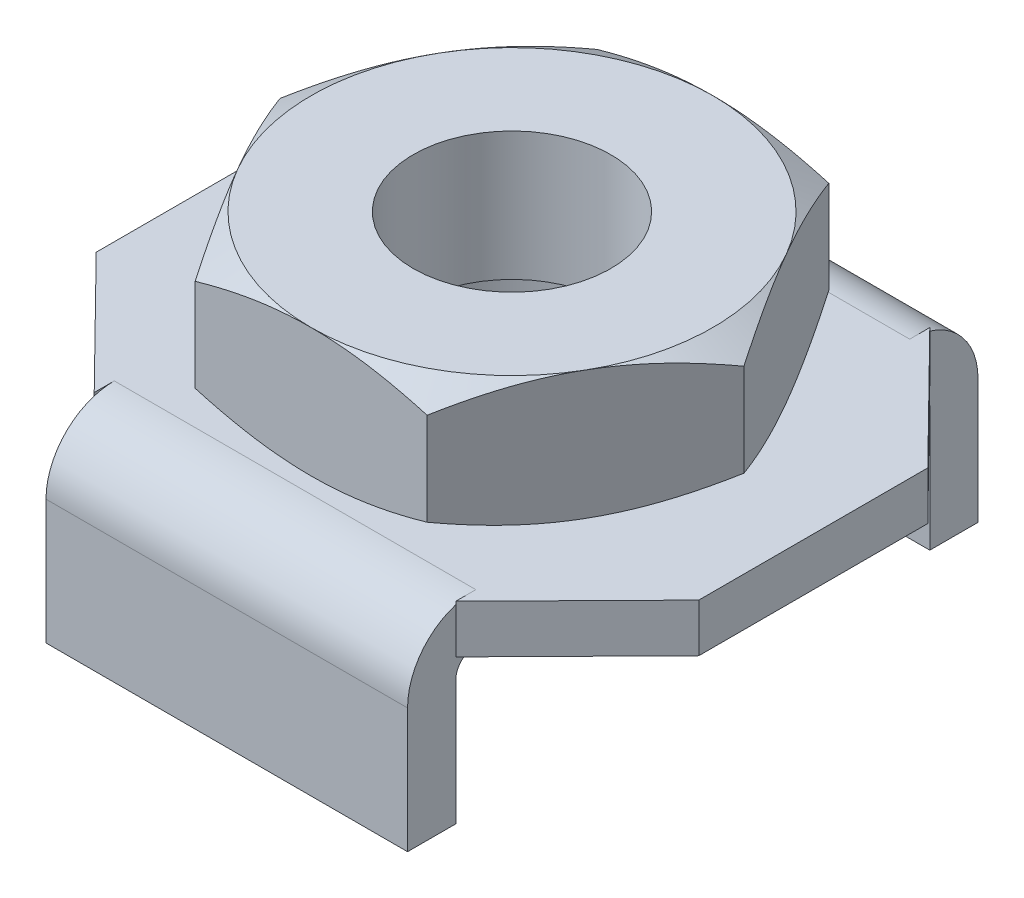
ISO-10303-21;
HEADER;
FILE_DESCRIPTION(('STEP AP214'),'2;1');
FILE_NAME('part.step','',(''),(''),'','','');
FILE_SCHEMA(('AUTOMOTIVE_DESIGN { 1 0 10303 214 1 1 1 1 }'));
ENDSEC;
DATA;
#1=APPLICATION_CONTEXT('core data for automotive mechanical design processes');
#2=APPLICATION_PROTOCOL_DEFINITION('international standard','automotive_design',2000,#1);
#3=PRODUCT_CONTEXT('',#1,'mechanical');
#4=PRODUCT('Part','Part','',(#3));
#5=PRODUCT_RELATED_PRODUCT_CATEGORY('part','',(#4));
#6=PRODUCT_DEFINITION_FORMATION('','',#4);
#7=PRODUCT_DEFINITION_CONTEXT('part definition',#1,'design');
#8=PRODUCT_DEFINITION('design','',#6,#7);
#9=PRODUCT_DEFINITION_SHAPE('','',#8);
#10=(LENGTH_UNIT() NAMED_UNIT(*) SI_UNIT(.MILLI.,.METRE.));
#11=(NAMED_UNIT(*) PLANE_ANGLE_UNIT() SI_UNIT($,.RADIAN.));
#12=(NAMED_UNIT(*) SI_UNIT($,.STERADIAN.) SOLID_ANGLE_UNIT());
#13=UNCERTAINTY_MEASURE_WITH_UNIT(LENGTH_MEASURE(1.E-05),#10,'distance_accuracy_value','');
#14=(GEOMETRIC_REPRESENTATION_CONTEXT(3) GLOBAL_UNCERTAINTY_ASSIGNED_CONTEXT((#13)) GLOBAL_UNIT_ASSIGNED_CONTEXT((#10,
#11,#12)) REPRESENTATION_CONTEXT('',''));
#15=CARTESIAN_POINT('',(0.,0.,0.));
#16=DIRECTION('',(0.,0.,1.));
#17=DIRECTION('',(1.,0.,0.));
#18=AXIS2_PLACEMENT_3D('',#15,#16,#17);
#19=CARTESIAN_POINT('',(0.,3.95073852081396,0.));
#20=DIRECTION('',(0.,-1.,0.));
#21=DIRECTION('',(0.,0.,-1.));
#22=AXIS2_PLACEMENT_3D('',#19,#20,#21);
#23=CONICAL_SURFACE('',#22,5.77814370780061,1.04719755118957);
#24=CARTESIAN_POINT('',(0.,4.39999999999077,0.));
#25=DIRECTION('',(0.,-1.,0.));
#26=DIRECTION('',(0.,0.,-1.));
#27=AXIS2_PLACEMENT_3D('',#24,#25,#26);
#28=CIRCLE('',#27,4.99999999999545);
#29=CARTESIAN_POINT('',(-4.33012701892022,4.39999999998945,-2.49999999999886));
#30=VERTEX_POINT('',#29);
#31=CARTESIAN_POINT('',(0.,4.39999999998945,-4.99999999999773));
#32=VERTEX_POINT('',#31);
#33=EDGE_CURVE('E292',#30,#32,#28,.T.);
#34=ORIENTED_EDGE('',*,*,#33,.T.);
#35=CARTESIAN_POINT('',(-2.88675134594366,3.95341801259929,-5.00000000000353));
#36=CARTESIAN_POINT('',(-2.65177101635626,4.0212680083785,-5.00000000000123));
#37=CARTESIAN_POINT('',(-2.41490887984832,4.08343045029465,-5.00000000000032));
#38=CARTESIAN_POINT('',(-1.93909669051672,4.19305279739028,-4.99999999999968));
#39=CARTESIAN_POINT('',(-1.70016323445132,4.24058540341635,-4.99999999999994));
#40=CARTESIAN_POINT('',(-1.33950809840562,4.29894737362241,-5.00000000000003));
#41=CARTESIAN_POINT('',(-1.21883413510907,4.3162522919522,-5.00000000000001));
#42=CARTESIAN_POINT('',(-0.976908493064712,4.34620746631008,-4.99999999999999));
#43=CARTESIAN_POINT('',(-0.855656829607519,4.35885784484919,-5.));
#44=CARTESIAN_POINT('',(-0.612127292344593,4.37928167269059,-5.));
#45=CARTESIAN_POINT('',(-0.489847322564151,4.38703032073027,-5.));
#46=CARTESIAN_POINT('',(-0.245046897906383,4.39740020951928,-5.));
#47=CARTESIAN_POINT('',(-0.122526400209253,4.40002043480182,-5.));
#48=CARTESIAN_POINT('',(0.,4.39999999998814,-5.));
#49=B_SPLINE_CURVE_WITH_KNOTS('',3,(#35,#36,#37,#38,#39,#40,#41,#42,#43,#44,#45,#46,#47,#48),
.UNSPECIFIED.,.F.,.F.,(4,2,2,2,2,2,4),(0.,0.734036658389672,1.46436443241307,1.83000749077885,
2.19564092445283,2.56310985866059,2.93065154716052),.UNSPECIFIED.);
#50=CARTESIAN_POINT('',(-2.8867513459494,3.95341801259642,-4.9999999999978));
#51=VERTEX_POINT('',#50);
#52=EDGE_CURVE('E1322',#51,#32,#49,.T.);
#53=ORIENTED_EDGE('',*,*,#52,.F.);
#54=CARTESIAN_POINT('',(-4.33012701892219,4.39999999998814,-2.5));
#55=CARTESIAN_POINT('',(-4.26886381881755,4.40002043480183,-2.60611097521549));
#56=CARTESIAN_POINT('',(-4.20760356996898,4.39740020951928,-2.71221683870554));
#57=CARTESIAN_POINT('',(-4.08520335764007,4.38703032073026,-2.92422022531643));
#58=CARTESIAN_POINT('',(-4.02406337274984,4.37928167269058,-3.0301177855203));
#59=CARTESIAN_POINT('',(-3.90229860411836,4.35885784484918,-3.24102055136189));
#60=CARTESIAN_POINT('',(-3.84167277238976,4.34620746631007,-3.34602757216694));
#61=CARTESIAN_POINT('',(-3.72070995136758,4.31625229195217,-3.55554132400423));
#62=CARTESIAN_POINT('',(-3.6603729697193,4.29894737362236,-3.6600480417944));
#63=CARTESIAN_POINT('',(-3.48004540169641,4.24058540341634,-3.97238455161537));
#64=CARTESIAN_POINT('',(-3.36057867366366,4.19305279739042,-4.17930699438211));
#65=CARTESIAN_POINT('',(-3.12267257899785,4.08343045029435,-4.59137243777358));
#66=CARTESIAN_POINT('',(-3.00424151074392,4.02126800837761,-4.79650106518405));
#67=CARTESIAN_POINT('',(-2.88675134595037,3.95341801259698,-4.99999999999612));
#68=B_SPLINE_CURVE_WITH_KNOTS('',3,(#54,#55,#56,#57,#58,#59,#60,#61,#62,#63,#64,#65,#66,#67),
.UNSPECIFIED.,.F.,.F.,(4,2,2,2,2,2,4),(0.,0.367541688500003,0.735010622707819,1.10064405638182,
1.46628711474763,2.1966148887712,2.9306515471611),.UNSPECIFIED.);
#69=EDGE_CURVE('E289',#30,#51,#68,.T.);
#70=ORIENTED_EDGE('',*,*,#69,.F.);
#71=EDGE_LOOP('',(#34,#53,#70));
#72=FACE_BOUND('',#71,.T.);
#73=ADVANCED_FACE('F17',(#72),#23,.T.);
#74=CARTESIAN_POINT('',(0.,3.95073852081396,0.));
#75=DIRECTION('',(0.,-1.,0.));
#76=DIRECTION('',(0.,0.,-1.));
#77=AXIS2_PLACEMENT_3D('',#74,#75,#76);
#78=CONICAL_SURFACE('',#77,5.77814370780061,1.04719755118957);
#79=CARTESIAN_POINT('',(0.,4.39999999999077,0.));
#80=DIRECTION('',(0.,-1.,0.));
#81=DIRECTION('',(0.,0.,-1.));
#82=AXIS2_PLACEMENT_3D('',#79,#80,#81);
#83=CIRCLE('',#82,4.99999999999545);
#84=CARTESIAN_POINT('',(4.33012701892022,4.39999999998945,-2.49999999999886));
#85=VERTEX_POINT('',#84);
#86=EDGE_CURVE('E286',#32,#85,#83,.T.);
#87=ORIENTED_EDGE('',*,*,#86,.T.);
#88=CARTESIAN_POINT('',(2.88675134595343,3.95341801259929,-4.99999999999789));
#89=CARTESIAN_POINT('',(3.00424151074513,4.02126800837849,-4.79650106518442));
#90=CARTESIAN_POINT('',(3.12267257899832,4.08343045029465,-4.59137243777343));
#91=CARTESIAN_POINT('',(3.36057867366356,4.19305279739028,-4.17930699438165));
#92=CARTESIAN_POINT('',(3.48004540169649,4.24058540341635,-3.97238455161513));
#93=CARTESIAN_POINT('',(3.66037296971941,4.2989473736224,-3.66004804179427));
#94=CARTESIAN_POINT('',(3.72070995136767,4.3162522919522,-3.55554132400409));
#95=CARTESIAN_POINT('',(3.84167277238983,4.34620746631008,-3.34602757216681));
#96=CARTESIAN_POINT('',(3.90229860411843,4.35885784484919,-3.24102055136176));
#97=CARTESIAN_POINT('',(4.0240633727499,4.37928167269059,-3.03011778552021));
#98=CARTESIAN_POINT('',(4.08520335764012,4.38703032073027,-2.92422022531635));
#99=CARTESIAN_POINT('',(4.207603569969,4.39740020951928,-2.7122168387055));
#100=CARTESIAN_POINT('',(4.26886381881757,4.40002043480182,-2.60611097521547));
#101=CARTESIAN_POINT('',(4.33012701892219,4.39999999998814,-2.5));
#102=B_SPLINE_CURVE_WITH_KNOTS('',3,(#88,#89,#90,#91,#92,#93,#94,#95,#96,#97,#98,#99,#100,#101),
.UNSPECIFIED.,.F.,.F.,(4,2,2,2,2,2,4),(0.,0.73403665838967,1.46436443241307,1.83000749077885,
2.19564092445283,2.56310985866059,2.93065154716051),.UNSPECIFIED.);
#103=CARTESIAN_POINT('',(2.88675134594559,3.95341801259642,-5.));
#104=VERTEX_POINT('',#103);
#105=EDGE_CURVE('E513',#104,#85,#102,.T.);
#106=ORIENTED_EDGE('',*,*,#105,.F.);
#107=CARTESIAN_POINT('',(0.,4.39999999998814,-5.));
#108=CARTESIAN_POINT('',(0.122526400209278,4.40002043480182,-5.));
#109=CARTESIAN_POINT('',(0.245046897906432,4.39740020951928,-5.));
#110=CARTESIAN_POINT('',(0.489847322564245,4.38703032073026,-5.));
#111=CARTESIAN_POINT('',(0.612127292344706,4.37928167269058,-5.));
#112=CARTESIAN_POINT('',(0.85565682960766,4.35885784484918,-5.));
#113=CARTESIAN_POINT('',(0.97690849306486,4.34620746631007,-5.));
#114=CARTESIAN_POINT('',(1.21883413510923,4.31625229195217,-5.));
#115=CARTESIAN_POINT('',(1.33950809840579,4.29894737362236,-5.));
#116=CARTESIAN_POINT('',(1.70016323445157,4.24058540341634,-5.));
#117=CARTESIAN_POINT('',(1.93909669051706,4.19305279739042,-5.));
#118=CARTESIAN_POINT('',(2.41490887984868,4.08343045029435,-5.));
#119=CARTESIAN_POINT('',(2.65177101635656,4.02126800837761,-5.));
#120=CARTESIAN_POINT('',(2.88675134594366,3.95341801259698,-5.));
#121=B_SPLINE_CURVE_WITH_KNOTS('',3,(#107,#108,#109,#110,#111,#112,#113,#114,#115,#116,#117,
#118,#119,#120),.UNSPECIFIED.,.F.,.F.,(4,2,2,2,2,2,4),(0.,0.367541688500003,0.735010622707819,
1.10064405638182,1.46628711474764,2.1966148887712,2.9306515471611),.UNSPECIFIED.);
#122=EDGE_CURVE('E439',#32,#104,#121,.T.);
#123=ORIENTED_EDGE('',*,*,#122,.F.);
#124=EDGE_LOOP('',(#87,#106,#123));
#125=FACE_BOUND('',#124,.T.);
#126=ADVANCED_FACE('F641',(#125),#78,.T.);
#127=CARTESIAN_POINT('',(0.,3.95073852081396,0.));
#128=DIRECTION('',(0.,-1.,0.));
#129=DIRECTION('',(0.,0.,-1.));
#130=AXIS2_PLACEMENT_3D('',#127,#128,#129);
#131=CONICAL_SURFACE('',#130,5.77814370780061,1.04719755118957);
#132=CARTESIAN_POINT('',(4.33012701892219,4.39999999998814,-2.5));
#133=CARTESIAN_POINT('',(4.39139021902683,4.40002043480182,-2.39388902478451));
#134=CARTESIAN_POINT('',(4.45265046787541,4.39740020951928,-2.28778316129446));
#135=CARTESIAN_POINT('',(4.57505068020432,4.38703032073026,-2.07577977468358));
#136=CARTESIAN_POINT('',(4.63619066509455,4.37928167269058,-1.9698822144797));
#137=CARTESIAN_POINT('',(4.75795543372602,4.35885784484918,-1.75897944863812));
#138=CARTESIAN_POINT('',(4.81858126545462,4.34620746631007,-1.65397242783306));
#139=CARTESIAN_POINT('',(4.93954408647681,4.31625229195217,-1.44445867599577));
#140=CARTESIAN_POINT('',(4.99988106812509,4.29894737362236,-1.3399519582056));
#141=CARTESIAN_POINT('',(5.18020863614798,4.24058540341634,-1.02761544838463));
#142=CARTESIAN_POINT('',(5.29967536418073,4.19305279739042,-0.820693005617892));
#143=CARTESIAN_POINT('',(5.53758145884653,4.08343045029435,-0.408627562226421));
#144=CARTESIAN_POINT('',(5.65601252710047,4.02126800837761,-0.203498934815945));
#145=CARTESIAN_POINT('',(5.77350269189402,3.95341801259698,-3.87538759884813E-12));
#146=B_SPLINE_CURVE_WITH_KNOTS('',3,(#132,#133,#134,#135,#136,#137,#138,#139,#140,#141,#142,
#143,#144,#145),.UNSPECIFIED.,.F.,.F.,(4,2,2,2,2,2,4),(0.,0.367541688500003,0.735010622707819,
1.10064405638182,1.46628711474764,2.1966148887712,2.9306515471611),.UNSPECIFIED.);
#147=CARTESIAN_POINT('',(5.77350269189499,3.95341801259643,-2.20414834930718E-12));
#148=VERTEX_POINT('',#147);
#149=EDGE_CURVE('E283',#85,#148,#146,.T.);
#150=ORIENTED_EDGE('',*,*,#149,.F.);
#151=CARTESIAN_POINT('',(0.,4.39999999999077,0.));
#152=DIRECTION('',(0.,-1.,0.));
#153=DIRECTION('',(0.,0.,-1.));
#154=AXIS2_PLACEMENT_3D('',#151,#152,#153);
#155=CIRCLE('',#154,4.99999999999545);
#156=CARTESIAN_POINT('',(4.33012701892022,4.39999999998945,2.49999999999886));
#157=VERTEX_POINT('',#156);
#158=EDGE_CURVE('E281',#85,#157,#155,.T.);
#159=ORIENTED_EDGE('',*,*,#158,.T.);
#160=CARTESIAN_POINT('',(5.77350269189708,3.95341801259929,5.6395068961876E-12));
#161=CARTESIAN_POINT('',(5.65601252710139,4.0212680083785,0.203498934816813));
#162=CARTESIAN_POINT('',(5.53758145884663,4.08343045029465,0.408627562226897));
#163=CARTESIAN_POINT('',(5.29967536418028,4.19305279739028,0.820693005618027));
#164=CARTESIAN_POINT('',(5.1802086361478,4.24058540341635,1.02761544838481));
#165=CARTESIAN_POINT('',(4.99988106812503,4.29894737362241,1.33995195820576));
#166=CARTESIAN_POINT('',(4.93954408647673,4.3162522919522,1.44445867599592));
#167=CARTESIAN_POINT('',(4.81858126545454,4.34620746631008,1.65397242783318));
#168=CARTESIAN_POINT('',(4.75795543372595,4.35885784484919,1.75897944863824));
#169=CARTESIAN_POINT('',(4.63619066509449,4.37928167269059,1.9698822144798));
#170=CARTESIAN_POINT('',(4.57505068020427,4.38703032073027,2.07577977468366));
#171=CARTESIAN_POINT('',(4.45265046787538,4.39740020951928,2.2877831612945));
#172=CARTESIAN_POINT('',(4.39139021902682,4.40002043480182,2.39388902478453));
#173=CARTESIAN_POINT('',(4.33012701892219,4.39999999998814,2.5));
#174=B_SPLINE_CURVE_WITH_KNOTS('',3,(#160,#161,#162,#163,#164,#165,#166,#167,#168,#169,#170,
#171,#172,#173),.UNSPECIFIED.,.F.,.F.,(4,2,2,2,2,2,4),(0.,0.734036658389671,1.46436443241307,
1.83000749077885,2.19564092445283,2.56310985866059,2.93065154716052),.UNSPECIFIED.);
#175=EDGE_CURVE('E270',#148,#157,#174,.T.);
#176=ORIENTED_EDGE('',*,*,#175,.F.);
#177=EDGE_LOOP('',(#150,#159,#176));
#178=FACE_BOUND('',#177,.T.);
#179=ADVANCED_FACE('F282',(#178),#131,.T.);
#180=CARTESIAN_POINT('',(0.,3.95073852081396,0.));
#181=DIRECTION('',(0.,-1.,0.));
#182=DIRECTION('',(0.,0.,-1.));
#183=AXIS2_PLACEMENT_3D('',#180,#181,#182);
#184=CONICAL_SURFACE('',#183,5.77814370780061,1.04719755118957);
#185=CARTESIAN_POINT('',(0.,4.39999999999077,0.));
#186=DIRECTION('',(0.,-1.,0.));
#187=DIRECTION('',(0.,0.,-1.));
#188=AXIS2_PLACEMENT_3D('',#185,#186,#187);
#189=CIRCLE('',#188,4.99999999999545);
#190=CARTESIAN_POINT('',(0.,4.39999999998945,4.99999999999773));
#191=VERTEX_POINT('',#190);
#192=EDGE_CURVE('E21',#157,#191,#189,.T.);
#193=ORIENTED_EDGE('',*,*,#192,.T.);
#194=CARTESIAN_POINT('',(2.88675134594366,3.95341801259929,5.00000000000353));
#195=CARTESIAN_POINT('',(2.65177101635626,4.0212680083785,5.00000000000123));
#196=CARTESIAN_POINT('',(2.41490887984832,4.08343045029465,5.00000000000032));
#197=CARTESIAN_POINT('',(1.93909669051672,4.19305279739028,4.99999999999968));
#198=CARTESIAN_POINT('',(1.70016323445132,4.24058540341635,4.99999999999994));
#199=CARTESIAN_POINT('',(1.33950809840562,4.29894737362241,5.00000000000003));
#200=CARTESIAN_POINT('',(1.21883413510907,4.3162522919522,5.00000000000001));
#201=CARTESIAN_POINT('',(0.976908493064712,4.34620746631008,4.99999999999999));
#202=CARTESIAN_POINT('',(0.855656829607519,4.35885784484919,5.));
#203=CARTESIAN_POINT('',(0.612127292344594,4.37928167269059,5.));
#204=CARTESIAN_POINT('',(0.489847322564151,4.38703032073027,5.));
#205=CARTESIAN_POINT('',(0.245046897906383,4.39740020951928,5.));
#206=CARTESIAN_POINT('',(0.122526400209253,4.40002043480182,5.));
#207=CARTESIAN_POINT('',(0.,4.39999999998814,5.));
#208=B_SPLINE_CURVE_WITH_KNOTS('',3,(#194,#195,#196,#197,#198,#199,#200,#201,#202,#203,#204,
#205,#206,#207),.UNSPECIFIED.,.F.,.F.,(4,2,2,2,2,2,4),(0.,0.734036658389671,1.46436443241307,
1.83000749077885,2.19564092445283,2.56310985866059,2.93065154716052),.UNSPECIFIED.);
#209=CARTESIAN_POINT('',(2.8867513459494,3.95341801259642,4.9999999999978));
#210=VERTEX_POINT('',#209);
#211=EDGE_CURVE('E256',#210,#191,#208,.T.);
#212=ORIENTED_EDGE('',*,*,#211,.F.);
#213=CARTESIAN_POINT('',(4.33012701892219,4.39999999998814,2.5));
#214=CARTESIAN_POINT('',(4.26886381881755,4.40002043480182,2.60611097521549));
#215=CARTESIAN_POINT('',(4.20760356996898,4.39740020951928,2.71221683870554));
#216=CARTESIAN_POINT('',(4.08520335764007,4.38703032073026,2.92422022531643));
#217=CARTESIAN_POINT('',(4.02406337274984,4.37928167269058,3.0301177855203));
#218=CARTESIAN_POINT('',(3.90229860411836,4.35885784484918,3.24102055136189));
#219=CARTESIAN_POINT('',(3.84167277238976,4.34620746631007,3.34602757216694));
#220=CARTESIAN_POINT('',(3.72070995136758,4.31625229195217,3.55554132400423));
#221=CARTESIAN_POINT('',(3.6603729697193,4.29894737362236,3.6600480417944));
#222=CARTESIAN_POINT('',(3.48004540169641,4.24058540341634,3.97238455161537));
#223=CARTESIAN_POINT('',(3.36057867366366,4.19305279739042,4.17930699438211));
#224=CARTESIAN_POINT('',(3.12267257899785,4.08343045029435,4.59137243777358));
#225=CARTESIAN_POINT('',(3.00424151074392,4.02126800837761,4.79650106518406));
#226=CARTESIAN_POINT('',(2.88675134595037,3.95341801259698,4.99999999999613));
#227=B_SPLINE_CURVE_WITH_KNOTS('',3,(#213,#214,#215,#216,#217,#218,#219,#220,#221,#222,#223,
#224,#225,#226),.UNSPECIFIED.,.F.,.F.,(4,2,2,2,2,2,4),(0.,0.367541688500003,0.735010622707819,
1.10064405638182,1.46628711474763,2.1966148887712,2.9306515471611),.UNSPECIFIED.);
#228=EDGE_CURVE('E267',#157,#210,#227,.T.);
#229=ORIENTED_EDGE('',*,*,#228,.F.);
#230=EDGE_LOOP('',(#193,#212,#229));
#231=FACE_BOUND('',#230,.T.);
#232=ADVANCED_FACE('F266',(#231),#184,.T.);
#233=CARTESIAN_POINT('',(0.,3.95073852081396,0.));
#234=DIRECTION('',(0.,-1.,0.));
#235=DIRECTION('',(0.,0.,-1.));
#236=AXIS2_PLACEMENT_3D('',#233,#234,#235);
#237=CONICAL_SURFACE('',#236,5.77814370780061,1.04719755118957);
#238=CARTESIAN_POINT('',(0.,4.39999999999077,0.));
#239=DIRECTION('',(0.,-1.,0.));
#240=DIRECTION('',(0.,0.,-1.));
#241=AXIS2_PLACEMENT_3D('',#238,#239,#240);
#242=CIRCLE('',#241,4.99999999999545);
#243=CARTESIAN_POINT('',(-4.33012701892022,4.39999999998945,2.49999999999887));
#244=VERTEX_POINT('',#243);
#245=EDGE_CURVE('E239',#191,#244,#242,.T.);
#246=ORIENTED_EDGE('',*,*,#245,.T.);
#247=CARTESIAN_POINT('',(-2.88675134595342,3.95341801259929,4.99999999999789));
#248=CARTESIAN_POINT('',(-3.00424151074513,4.0212680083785,4.79650106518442));
#249=CARTESIAN_POINT('',(-3.12267257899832,4.08343045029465,4.59137243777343));
#250=CARTESIAN_POINT('',(-3.36057867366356,4.19305279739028,4.17930699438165));
#251=CARTESIAN_POINT('',(-3.48004540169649,4.24058540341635,3.97238455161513));
#252=CARTESIAN_POINT('',(-3.66037296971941,4.2989473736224,3.66004804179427));
#253=CARTESIAN_POINT('',(-3.72070995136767,4.3162522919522,3.5555413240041));
#254=CARTESIAN_POINT('',(-3.84167277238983,4.34620746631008,3.34602757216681));
#255=CARTESIAN_POINT('',(-3.90229860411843,4.35885784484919,3.24102055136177));
#256=CARTESIAN_POINT('',(-4.0240633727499,4.37928167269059,3.03011778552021));
#257=CARTESIAN_POINT('',(-4.08520335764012,4.38703032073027,2.92422022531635));
#258=CARTESIAN_POINT('',(-4.207603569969,4.39740020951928,2.7122168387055));
#259=CARTESIAN_POINT('',(-4.26886381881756,4.40002043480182,2.60611097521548));
#260=CARTESIAN_POINT('',(-4.33012701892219,4.39999999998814,2.5));
#261=B_SPLINE_CURVE_WITH_KNOTS('',3,(#247,#248,#249,#250,#251,#252,#253,#254,#255,#256,#257,
#258,#259,#260),.UNSPECIFIED.,.F.,.F.,(4,2,2,2,2,2,4),(0.,0.73403665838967,1.46436443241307,
1.83000749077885,2.19564092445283,2.56310985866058,2.93065154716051),.UNSPECIFIED.);
#262=CARTESIAN_POINT('',(-2.88675134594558,3.95341801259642,5.));
#263=VERTEX_POINT('',#262);
#264=EDGE_CURVE('E251',#263,#244,#261,.T.);
#265=ORIENTED_EDGE('',*,*,#264,.F.);
#266=CARTESIAN_POINT('',(0.,4.39999999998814,5.));
#267=CARTESIAN_POINT('',(-0.122526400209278,4.40002043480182,5.));
#268=CARTESIAN_POINT('',(-0.245046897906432,4.39740020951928,5.));
#269=CARTESIAN_POINT('',(-0.489847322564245,4.38703032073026,5.));
#270=CARTESIAN_POINT('',(-0.612127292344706,4.37928167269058,5.));
#271=CARTESIAN_POINT('',(-0.855656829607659,4.35885784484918,5.));
#272=CARTESIAN_POINT('',(-0.97690849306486,4.34620746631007,5.));
#273=CARTESIAN_POINT('',(-1.21883413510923,4.31625229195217,5.));
#274=CARTESIAN_POINT('',(-1.33950809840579,4.29894737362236,5.));
#275=CARTESIAN_POINT('',(-1.70016323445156,4.24058540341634,5.));
#276=CARTESIAN_POINT('',(-1.93909669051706,4.19305279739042,5.));
#277=CARTESIAN_POINT('',(-2.41490887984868,4.08343045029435,5.));
#278=CARTESIAN_POINT('',(-2.65177101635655,4.02126800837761,5.));
#279=CARTESIAN_POINT('',(-2.88675134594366,3.95341801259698,5.));
#280=B_SPLINE_CURVE_WITH_KNOTS('',3,(#266,#267,#268,#269,#270,#271,#272,#273,#274,#275,#276,
#277,#278,#279),.UNSPECIFIED.,.F.,.F.,(4,2,2,2,2,2,4),(0.,0.367541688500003,0.735010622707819,
1.10064405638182,1.46628711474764,2.1966148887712,2.9306515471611),.UNSPECIFIED.);
#281=EDGE_CURVE('E247',#191,#263,#280,.T.);
#282=ORIENTED_EDGE('',*,*,#281,.F.);
#283=EDGE_LOOP('',(#246,#265,#282));
#284=FACE_BOUND('',#283,.T.);
#285=ADVANCED_FACE('F249',(#284),#237,.T.);
#286=CARTESIAN_POINT('',(0.,3.95073852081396,0.));
#287=DIRECTION('',(0.,-1.,0.));
#288=DIRECTION('',(0.,0.,-1.));
#289=AXIS2_PLACEMENT_3D('',#286,#287,#288);
#290=CONICAL_SURFACE('',#289,5.77814370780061,1.04719755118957);
#291=CARTESIAN_POINT('',(-4.33012701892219,4.39999999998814,2.5));
#292=CARTESIAN_POINT('',(-4.39139021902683,4.40002043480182,2.39388902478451));
#293=CARTESIAN_POINT('',(-4.45265046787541,4.39740020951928,2.28778316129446));
#294=CARTESIAN_POINT('',(-4.57505068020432,4.38703032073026,2.07577977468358));
#295=CARTESIAN_POINT('',(-4.63619066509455,4.37928167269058,1.9698822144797));
#296=CARTESIAN_POINT('',(-4.75795543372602,4.35885784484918,1.75897944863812));
#297=CARTESIAN_POINT('',(-4.81858126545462,4.34620746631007,1.65397242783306));
#298=CARTESIAN_POINT('',(-4.93954408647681,4.31625229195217,1.44445867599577));
#299=CARTESIAN_POINT('',(-4.99988106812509,4.29894737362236,1.3399519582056));
#300=CARTESIAN_POINT('',(-5.18020863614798,4.24058540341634,1.02761544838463));
#301=CARTESIAN_POINT('',(-5.29967536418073,4.19305279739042,0.820693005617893));
#302=CARTESIAN_POINT('',(-5.53758145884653,4.08343045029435,0.408627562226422));
#303=CARTESIAN_POINT('',(-5.65601252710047,4.02126800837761,0.203498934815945));
#304=CARTESIAN_POINT('',(-5.77350269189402,3.95341801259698,3.87535096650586E-12));
#305=B_SPLINE_CURVE_WITH_KNOTS('',3,(#291,#292,#293,#294,#295,#296,#297,#298,#299,#300,#301,
#302,#303,#304),.UNSPECIFIED.,.F.,.F.,(4,2,2,2,2,2,4),(0.,0.367541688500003,0.73501062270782,
1.10064405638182,1.46628711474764,2.1966148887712,2.9306515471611),.UNSPECIFIED.);
#306=CARTESIAN_POINT('',(-5.77350269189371,3.95341801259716,0.));
#307=VERTEX_POINT('',#306);
#308=EDGE_CURVE('E308',#244,#307,#305,.T.);
#309=ORIENTED_EDGE('',*,*,#308,.F.);
#310=CARTESIAN_POINT('',(0.,4.39999999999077,0.));
#311=DIRECTION('',(0.,-1.,0.));
#312=DIRECTION('',(0.,0.,-1.));
#313=AXIS2_PLACEMENT_3D('',#310,#311,#312);
#314=CIRCLE('',#313,4.99999999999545);
#315=EDGE_CURVE('E243',#244,#30,#314,.T.);
#316=ORIENTED_EDGE('',*,*,#315,.T.);
#317=CARTESIAN_POINT('',(-5.77350269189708,3.95341801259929,-5.63914765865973E-12));
#318=CARTESIAN_POINT('',(-5.65601252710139,4.0212680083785,-0.203498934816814));
#319=CARTESIAN_POINT('',(-5.53758145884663,4.08343045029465,-0.408627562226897));
#320=CARTESIAN_POINT('',(-5.29967536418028,4.19305279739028,-0.820693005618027));
#321=CARTESIAN_POINT('',(-5.1802086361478,4.24058540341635,-1.02761544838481));
#322=CARTESIAN_POINT('',(-4.99988106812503,4.29894737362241,-1.33995195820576));
#323=CARTESIAN_POINT('',(-4.93954408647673,4.3162522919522,-1.44445867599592));
#324=CARTESIAN_POINT('',(-4.81858126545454,4.34620746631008,-1.65397242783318));
#325=CARTESIAN_POINT('',(-4.75795543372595,4.35885784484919,-1.75897944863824));
#326=CARTESIAN_POINT('',(-4.63619066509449,4.37928167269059,-1.9698822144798));
#327=CARTESIAN_POINT('',(-4.57505068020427,4.38703032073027,-2.07577977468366));
#328=CARTESIAN_POINT('',(-4.45265046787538,4.39740020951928,-2.2877831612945));
#329=CARTESIAN_POINT('',(-4.39139021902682,4.40002043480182,-2.39388902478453));
#330=CARTESIAN_POINT('',(-4.33012701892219,4.39999999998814,-2.5));
#331=B_SPLINE_CURVE_WITH_KNOTS('',3,(#317,#318,#319,#320,#321,#322,#323,#324,#325,#326,#327,
#328,#329,#330),.UNSPECIFIED.,.F.,.F.,(4,2,2,2,2,2,4),(0.,0.734036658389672,1.46436443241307,
1.83000749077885,2.19564092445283,2.56310985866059,2.93065154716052),.UNSPECIFIED.);
#332=EDGE_CURVE('E285',#307,#30,#331,.T.);
#333=ORIENTED_EDGE('',*,*,#332,.F.);
#334=EDGE_LOOP('',(#309,#316,#333));
#335=FACE_BOUND('',#334,.T.);
#336=ADVANCED_FACE('F306',(#335),#290,.T.);
#337=CARTESIAN_POINT('',(0.,4.4,0.));
#338=DIRECTION('',(0.,-1.,0.));
#339=DIRECTION('',(0.,0.,-1.));
#340=AXIS2_PLACEMENT_3D('',#337,#338,#339);
#341=PLANE('',#340);
#342=CARTESIAN_POINT('',(0.,4.4,0.));
#343=DIRECTION('',(0.,1.,0.));
#344=DIRECTION('',(0.,0.,1.));
#345=AXIS2_PLACEMENT_3D('',#342,#343,#344);
#346=CIRCLE('',#345,2.4585);
#347=CARTESIAN_POINT('',(0.,4.4,2.4585));
#348=VERTEX_POINT('',#347);
#349=EDGE_CURVE('E494',#348,#348,#346,.F.);
#350=ORIENTED_EDGE('',*,*,#349,.T.);
#351=EDGE_LOOP('',(#350));
#352=FACE_BOUND('',#351,.T.);
#353=ORIENTED_EDGE('',*,*,#86,.F.);
#354=ORIENTED_EDGE('',*,*,#33,.F.);
#355=ORIENTED_EDGE('',*,*,#315,.F.);
#356=ORIENTED_EDGE('',*,*,#245,.F.);
#357=ORIENTED_EDGE('',*,*,#192,.F.);
#358=ORIENTED_EDGE('',*,*,#158,.F.);
#359=EDGE_LOOP('',(#353,#354,#355,#356,#357,#358));
#360=FACE_BOUND('',#359,.T.);
#361=ADVANCED_FACE('F241',(#352,#360),#341,.F.);
#362=CARTESIAN_POINT('',(-2.88675134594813,1.2,-5.));
#363=DIRECTION('',(-0.866025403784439,0.,-0.5));
#364=DIRECTION('',(-0.5,0.,0.866025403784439));
#365=AXIS2_PLACEMENT_3D('',#362,#363,#364);
#366=PLANE('',#365);
#367=CARTESIAN_POINT('',(-5.77350267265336,1.64658198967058,-1.02148274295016E-08));
#368=CARTESIAN_POINT('',(-5.65601251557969,1.57873198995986,-0.20349894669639));
#369=CARTESIAN_POINT('',(-5.53758145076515,1.51656954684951,-0.408627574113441));
#370=CARTESIAN_POINT('',(-5.29967535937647,1.40694719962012,-0.820693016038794));
#371=CARTESIAN_POINT('',(-5.1802086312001,1.35941459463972,-1.02761545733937));
#372=CARTESIAN_POINT('',(-4.99988106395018,1.30105262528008,-1.3399519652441));
#373=CARTESIAN_POINT('',(-4.93954408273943,1.28374770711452,-1.44445868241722));
#374=CARTESIAN_POINT('',(-4.81858126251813,1.2537925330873,-1.65397243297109));
#375=CARTESIAN_POINT('',(-4.75795543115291,1.24114215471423,-1.75897945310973));
#376=CARTESIAN_POINT('',(-4.63619066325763,1.22071832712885,-1.9698822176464));
#377=CARTESIAN_POINT('',(-4.57505067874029,1.21296967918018,-2.07577977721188));
#378=CARTESIAN_POINT('',(-4.45265046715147,1.20259979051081,-2.28778316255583));
#379=CARTESIAN_POINT('',(-4.39139021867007,1.19997956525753,-2.39388902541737));
#380=CARTESIAN_POINT('',(-4.33012701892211,1.20000000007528,-2.50000000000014));
#381=B_SPLINE_CURVE_WITH_KNOTS('',3,(#367,#368,#369,#370,#371,#372,#373,#374,#375,#376,#377,
#378,#379,#380),.UNSPECIFIED.,.F.,.F.,(4,2,2,2,2,2,4),(0.,0.734036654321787,1.46436442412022,
1.8300074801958,2.19564091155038,2.56310984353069,2.93065152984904),.UNSPECIFIED.);
#382=CARTESIAN_POINT('',(-5.77350268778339,1.64658198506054,7.1236946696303E-09));
#383=VERTEX_POINT('',#382);
#384=CARTESIAN_POINT('',(-4.33012701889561,1.20000000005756,-2.49999999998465));
#385=VERTEX_POINT('',#384);
#386=EDGE_CURVE('E479',#383,#385,#381,.T.);
#387=ORIENTED_EDGE('',*,*,#386,.F.);
#388=DIRECTION('',(0.,1.,0.));
#389=VECTOR('',#388,1.);
#390=CARTESIAN_POINT('',(-5.77350269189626,1.2,0.));
#391=LINE('',#390,#389);
#392=EDGE_CURVE('E310',#307,#383,#391,.F.);
#393=ORIENTED_EDGE('',*,*,#392,.F.);
#394=ORIENTED_EDGE('',*,*,#332,.T.);
#395=ORIENTED_EDGE('',*,*,#69,.T.);
#396=DIRECTION('',(0.,1.,0.));
#397=VECTOR('',#396,1.);
#398=CARTESIAN_POINT('',(-2.88675134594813,1.2,-5.));
#399=LINE('',#398,#397);
#400=CARTESIAN_POINT('',(-2.88675132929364,1.64658199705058,-5.00000002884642));
#401=VERTEX_POINT('',#400);
#402=EDGE_CURVE('E510',#401,#51,#399,.T.);
#403=ORIENTED_EDGE('',*,*,#402,.F.);
#404=CARTESIAN_POINT('',(-4.33012701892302,1.20000000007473,-2.50000000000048));
#405=CARTESIAN_POINT('',(-4.26886381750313,1.19997956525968,-2.60611097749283));
#406=CARTESIAN_POINT('',(-4.20760356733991,1.20259979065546,-2.7122168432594));
#407=CARTESIAN_POINT('',(-4.08520335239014,1.2129696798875,-2.9242202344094));
#408=CARTESIAN_POINT('',(-4.02406336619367,1.22071832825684,-3.03011779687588));
#409=CARTESIAN_POINT('',(-3.9022985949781,1.24114215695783,-3.24102056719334));
#410=CARTESIAN_POINT('',(-3.84167276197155,1.25379253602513,-3.34602759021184));
#411=CARTESIAN_POINT('',(-3.7207099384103,1.2837477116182,-3.55554134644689));
#412=CARTESIAN_POINT('',(-3.6603729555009,1.30105263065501,-3.66004806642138));
#413=CARTESIAN_POINT('',(-3.48004538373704,1.35941460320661,-3.97238458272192));
#414=CARTESIAN_POINT('',(-3.36057865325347,1.40694721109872,-4.17930702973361));
#415=CARTESIAN_POINT('',(-3.1226725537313,1.51656956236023,-4.59137248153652));
#416=CARTESIAN_POINT('',(-3.00424148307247,1.5787320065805,-4.79650111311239));
#417=CARTESIAN_POINT('',(-2.88675131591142,1.64658200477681,-5.0000000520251));
#418=B_SPLINE_CURVE_WITH_KNOTS('',3,(#404,#405,#406,#407,#408,#409,#410,#411,#412,#413,#414,
#415,#416,#417),.UNSPECIFIED.,.F.,.F.,(4,2,2,2,2,2,4),(0.,0.367541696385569,0.735010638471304,
1.10064407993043,1.46628714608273,2.1966149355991,2.93065160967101),.UNSPECIFIED.);
#419=EDGE_CURVE('E454',#385,#401,#418,.T.);
#420=ORIENTED_EDGE('',*,*,#419,.F.);
#421=EDGE_LOOP('',(#387,#393,#394,#395,#403,#420));
#422=FACE_BOUND('',#421,.T.);
#423=ADVANCED_FACE('F432',(#422),#366,.T.);
#424=CARTESIAN_POINT('',(2.88675134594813,1.2,-5.));
#425=DIRECTION('',(0.,0.,-1.));
#426=DIRECTION('',(-1.,0.,0.));
#427=AXIS2_PLACEMENT_3D('',#424,#425,#426);
#428=PLANE('',#427);
#429=CARTESIAN_POINT('',(-2.88675124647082,1.64658195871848,-5.));
#430=CARTESIAN_POINT('',(-2.65177092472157,1.57873196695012,-5.));
#431=CARTESIAN_POINT('',(-2.41490879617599,1.51656952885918,-5.));
#432=CARTESIAN_POINT('',(-1.93909662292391,1.40694718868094,-5.));
#433=CARTESIAN_POINT('',(-1.70016317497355,1.35941458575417,-5.));
#434=CARTESIAN_POINT('',(-1.33950805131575,1.30105261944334,-5.));
#435=CARTESIAN_POINT('',(-1.21883409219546,1.28374770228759,-5.));
#436=CARTESIAN_POINT('',(-0.976908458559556,1.25379252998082,-5.));
#437=CARTESIAN_POINT('',(-0.855656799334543,1.2411421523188,-5.));
#438=CARTESIAN_POINT('',(-0.612127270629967,1.22071832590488,-5.));
#439=CARTESIAN_POINT('',(-0.489847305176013,1.2129696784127,-5.));
#440=CARTESIAN_POINT('',(-0.245046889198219,1.20259979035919,-5.));
#441=CARTESIAN_POINT('',(-0.122526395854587,1.19997956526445,-5.));
#442=CARTESIAN_POINT('',(1.58567457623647E-13,1.20000000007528,-5.));
#443=B_SPLINE_CURVE_WITH_KNOTS('',3,(#429,#430,#431,#432,#433,#434,#435,#436,#437,#438,#439,
#440,#441,#442),.UNSPECIFIED.,.F.,.F.,(4,2,2,2,2,2,4),(0.,0.734036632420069,1.46436438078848,
1.83000742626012,2.19564084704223,2.5631097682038,2.93065144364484),.UNSPECIFIED.);
#444=CARTESIAN_POINT('',(0.,1.20000000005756,-4.99999999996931));
#445=VERTEX_POINT('',#444);
#446=EDGE_CURVE('E448',#401,#445,#443,.T.);
#447=ORIENTED_EDGE('',*,*,#446,.F.);
#448=ORIENTED_EDGE('',*,*,#402,.T.);
#449=ORIENTED_EDGE('',*,*,#52,.T.);
#450=ORIENTED_EDGE('',*,*,#122,.T.);
#451=DIRECTION('',(0.,1.,0.));
#452=VECTOR('',#451,1.);
#453=CARTESIAN_POINT('',(2.88675134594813,1.2,-5.));
#454=LINE('',#453,#452);
#455=CARTESIAN_POINT('',(2.8867513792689,1.64658199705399,-5.));
#456=VERTEX_POINT('',#455);
#457=EDGE_CURVE('E279',#456,#104,#454,.T.);
#458=ORIENTED_EDGE('',*,*,#457,.F.);
#459=CARTESIAN_POINT('',(0.,1.20000000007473,-5.00000000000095));
#460=CARTESIAN_POINT('',(0.122526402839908,1.19997956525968,-5.00000000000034));
#461=CARTESIAN_POINT('',(0.245046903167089,1.20259979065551,-5.00000000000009));
#462=CARTESIAN_POINT('',(0.489847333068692,1.21296967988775,-4.99999999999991));
#463=CARTESIAN_POINT('',(0.612127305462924,1.22071832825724,-4.99999999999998));
#464=CARTESIAN_POINT('',(0.855656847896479,1.24114215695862,-5.00000000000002));
#465=CARTESIAN_POINT('',(0.976908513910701,1.25379253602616,-5.00000000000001));
#466=CARTESIAN_POINT('',(1.21883416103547,1.28374771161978,-4.99999999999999));
#467=CARTESIAN_POINT('',(1.3395081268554,1.30105263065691,-5.));
#468=CARTESIAN_POINT('',(1.70016327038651,1.35941460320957,-5.00000000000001));
#469=CARTESIAN_POINT('',(1.93909673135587,1.40694721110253,-5.));
#470=CARTESIAN_POINT('',(2.41490893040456,1.51656956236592,-5.));
#471=CARTESIAN_POINT('',(2.65177107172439,1.57873200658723,-4.99999999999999));
#472=CARTESIAN_POINT('',(2.88675140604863,1.64658200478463,-5.));
#473=B_SPLINE_CURVE_WITH_KNOTS('',3,(#459,#460,#461,#462,#463,#464,#465,#466,#467,#468,#469,
#470,#471,#472),.UNSPECIFIED.,.F.,.F.,(4,2,2,2,2,2,4),(0.,0.367541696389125,0.735010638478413,
1.10064407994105,1.46628714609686,2.19661493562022,2.9306516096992),.UNSPECIFIED.);
#474=EDGE_CURVE('E414',#445,#456,#473,.T.);
#475=ORIENTED_EDGE('',*,*,#474,.F.);
#476=EDGE_LOOP('',(#447,#448,#449,#450,#458,#475));
#477=FACE_BOUND('',#476,.T.);
#478=ADVANCED_FACE('F428',(#477),#428,.T.);
#479=CARTESIAN_POINT('',(5.77350269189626,1.2,0.));
#480=DIRECTION('',(0.866025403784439,0.,-0.5));
#481=DIRECTION('',(-0.5,0.,-0.866025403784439));
#482=AXIS2_PLACEMENT_3D('',#479,#480,#481);
#483=PLANE('',#482);
#484=CARTESIAN_POINT('',(2.88675139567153,1.64658195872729,-4.99999991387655));
#485=CARTESIAN_POINT('',(3.00424155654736,1.5787319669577,-4.79650098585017));
#486=CARTESIAN_POINT('',(3.12267262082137,1.51656952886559,-4.59137236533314));
#487=CARTESIAN_POINT('',(3.36057870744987,1.40694718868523,-4.17930693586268));
#488=CARTESIAN_POINT('',(3.4800454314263,1.35941458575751,-3.9723845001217));
#489=CARTESIAN_POINT('',(3.6603729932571,1.30105261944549,-3.66004800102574));
#490=CARTESIAN_POINT('',(3.72070997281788,1.28374770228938,-3.55554128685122));
#491=CARTESIAN_POINT('',(3.84167278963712,1.25379252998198,-3.34602754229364));
#492=CARTESIAN_POINT('',(3.90229861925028,1.24114215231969,-3.24102052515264));
#493=CARTESIAN_POINT('',(4.02406338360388,1.22071832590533,-3.03011776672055));
#494=CARTESIAN_POINT('',(4.08520336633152,1.21296967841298,-2.9242202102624));
#495=CARTESIAN_POINT('',(4.20760357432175,1.20259979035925,-2.71221683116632));
#496=CARTESIAN_POINT('',(4.26886382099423,1.19997956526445,-2.60611097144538));
#497=CARTESIAN_POINT('',(4.33012701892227,1.20000000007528,-2.49999999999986));
#498=B_SPLINE_CURVE_WITH_KNOTS('',3,(#484,#485,#486,#487,#488,#489,#490,#491,#492,#493,#494,
#495,#496,#497),.UNSPECIFIED.,.F.,.F.,(4,2,2,2,2,2,4),(0.,0.734036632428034,1.46436438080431,
1.83000742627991,2.19564084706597,2.56310976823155,2.93065144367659),.UNSPECIFIED.);
#499=CARTESIAN_POINT('',(4.33012701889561,1.20000000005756,-2.49999999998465));
#500=VERTEX_POINT('',#499);
#501=EDGE_CURVE('E422',#456,#500,#498,.T.);
#502=ORIENTED_EDGE('',*,*,#501,.F.);
#503=ORIENTED_EDGE('',*,*,#457,.T.);
#504=ORIENTED_EDGE('',*,*,#105,.T.);
#505=ORIENTED_EDGE('',*,*,#149,.T.);
#506=DIRECTION('',(0.,1.,0.));
#507=VECTOR('',#506,1.);
#508=CARTESIAN_POINT('',(5.77350269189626,1.2,0.));
#509=LINE('',#508,#507);
#510=CARTESIAN_POINT('',(5.77350270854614,1.64658199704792,2.88384482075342E-08));
#511=VERTEX_POINT('',#510);
#512=EDGE_CURVE('E264',#511,#148,#509,.T.);
#513=ORIENTED_EDGE('',*,*,#512,.F.);
#514=CARTESIAN_POINT('',(4.33012701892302,1.20000000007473,-2.50000000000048));
#515=CARTESIAN_POINT('',(4.39139022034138,1.19997956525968,-2.39388902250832));
#516=CARTESIAN_POINT('',(4.4526504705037,1.20259979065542,-2.28778315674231));
#517=CARTESIAN_POINT('',(4.57505068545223,1.21296967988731,-2.07577976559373));
#518=CARTESIAN_POINT('',(4.63619067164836,1.22071832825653,-1.96988220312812));
#519=CARTESIAN_POINT('',(4.75795544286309,1.24114215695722,-1.75897943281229));
#520=CARTESIAN_POINT('',(4.81858127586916,1.25379253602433,-1.65397240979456));
#521=CARTESIAN_POINT('',(4.93954409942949,1.28374771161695,-1.44445865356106));
#522=CARTESIAN_POINT('',(4.99988108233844,1.30105263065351,-1.33995193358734));
#523=CARTESIAN_POINT('',(5.18020865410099,1.35941460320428,-1.0276154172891));
#524=CARTESIAN_POINT('',(5.2996753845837,1.40694721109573,-0.820692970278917));
#525=CARTESIAN_POINT('',(5.53758148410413,1.51656956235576,-0.408627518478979));
#526=CARTESIAN_POINT('',(5.6560125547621,1.57873200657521,-0.203498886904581));
#527=CARTESIAN_POINT('',(5.77350272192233,1.64658200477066,5.2006672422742E-08));
#528=B_SPLINE_CURVE_WITH_KNOTS('',3,(#514,#515,#516,#517,#518,#519,#520,#521,#522,#523,#524,
#525,#526,#527),.UNSPECIFIED.,.F.,.F.,(4,2,2,2,2,2,4),(0.,0.367541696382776,0.73501063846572,
1.10064407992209,1.46628714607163,2.19661493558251,2.93065160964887),.UNSPECIFIED.);
#529=EDGE_CURVE('E402',#500,#511,#528,.T.);
#530=ORIENTED_EDGE('',*,*,#529,.F.);
#531=EDGE_LOOP('',(#502,#503,#504,#505,#513,#530));
#532=FACE_BOUND('',#531,.T.);
#533=ADVANCED_FACE('F431',(#532),#483,.T.);
#534=CARTESIAN_POINT('',(2.88675134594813,1.2,5.));
#535=DIRECTION('',(0.866025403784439,0.,0.5));
#536=DIRECTION('',(0.5,0.,-0.866025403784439));
#537=AXIS2_PLACEMENT_3D('',#534,#535,#536);
#538=PLANE('',#537);
#539=CARTESIAN_POINT('',(5.77350264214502,1.64658195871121,8.61716781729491E-08));
#540=CARTESIAN_POINT('',(5.65601248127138,1.57873196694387,0.203499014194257));
#541=CARTESIAN_POINT('',(5.5375814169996,1.51656952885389,0.408627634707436));
#542=CARTESIAN_POINT('',(5.29967533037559,1.4069471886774,0.820693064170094));
#543=CARTESIAN_POINT('',(5.18020860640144,1.35941458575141,1.02761549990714));
#544=CARTESIAN_POINT('',(4.99988104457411,1.30105261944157,1.33995199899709));
#545=CARTESIAN_POINT('',(4.93954406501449,1.28374770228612,1.44445871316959));
#546=CARTESIAN_POINT('',(4.8185812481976,1.25379252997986,1.65397245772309));
#547=CARTESIAN_POINT('',(4.75795541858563,1.24114215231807,1.75897947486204));
#548=CARTESIAN_POINT('',(4.63619065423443,1.22071832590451,1.96988223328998));
#549=CARTESIAN_POINT('',(4.575050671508,1.21296967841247,2.07577978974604));
#550=CARTESIAN_POINT('',(4.4526504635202,1.20259979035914,2.2877831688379));
#551=CARTESIAN_POINT('',(4.39139021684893,1.19997956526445,2.39388902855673));
#552=CARTESIAN_POINT('',(4.33012701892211,1.20000000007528,2.50000000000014));
#553=B_SPLINE_CURVE_WITH_KNOTS('',3,(#539,#540,#541,#542,#543,#544,#545,#546,#547,#548,#549,
#550,#551,#552),.UNSPECIFIED.,.F.,.F.,(4,2,2,2,2,2,4),(0.,0.734036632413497,1.46436438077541,
1.8300074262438,2.19564084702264,2.56310976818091,2.93065144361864),.UNSPECIFIED.);
#554=CARTESIAN_POINT('',(4.33012701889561,1.20000000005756,2.49999999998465));
#555=VERTEX_POINT('',#554);
#556=EDGE_CURVE('E408',#511,#555,#553,.T.);
#557=ORIENTED_EDGE('',*,*,#556,.F.);
#558=ORIENTED_EDGE('',*,*,#512,.T.);
#559=ORIENTED_EDGE('',*,*,#175,.T.);
#560=ORIENTED_EDGE('',*,*,#228,.T.);
#561=DIRECTION('',(0.,1.,0.));
#562=VECTOR('',#561,1.);
#563=CARTESIAN_POINT('',(2.88675134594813,1.2,5.));
#564=LINE('',#563,#562);
#565=CARTESIAN_POINT('',(2.88675137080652,1.64658197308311,4.99999995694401));
#566=VERTEX_POINT('',#565);
#567=EDGE_CURVE('E255',#566,#210,#564,.T.);
#568=ORIENTED_EDGE('',*,*,#567,.F.);
#569=CARTESIAN_POINT('',(4.33012701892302,1.20000000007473,2.50000000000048));
#570=CARTESIAN_POINT('',(4.26886382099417,1.19997956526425,2.60611097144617));
#571=CARTESIAN_POINT('',(4.20760357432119,1.20259979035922,2.71221683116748));
#572=CARTESIAN_POINT('',(4.08520336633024,1.21296967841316,2.92422021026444));
#573=CARTESIAN_POINT('',(4.02406338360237,1.22071832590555,3.03011776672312));
#574=CARTESIAN_POINT('',(3.90229861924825,1.24114215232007,3.2410205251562));
#575=CARTESIAN_POINT('',(3.8416727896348,1.25379252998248,3.34602754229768));
#576=CARTESIAN_POINT('',(3.72070997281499,1.28374770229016,3.5555412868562));
#577=CARTESIAN_POINT('',(3.66037299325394,1.30105261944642,3.6600480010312));
#578=CARTESIAN_POINT('',(3.48004543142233,1.35941458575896,3.97238450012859));
#579=CARTESIAN_POINT('',(3.36057870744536,1.40694718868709,4.1793069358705));
#580=CARTESIAN_POINT('',(3.12267262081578,1.51656952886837,4.5913723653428));
#581=CARTESIAN_POINT('',(3.00424155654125,1.578731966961,4.79650098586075));
#582=CARTESIAN_POINT('',(2.8867513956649,1.64658195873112,4.99999991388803));
#583=B_SPLINE_CURVE_WITH_KNOTS('',3,(#569,#570,#571,#572,#573,#574,#575,#576,#577,#578,#579,
#580,#581,#582),.UNSPECIFIED.,.F.,.F.,(4,2,2,2,2,2,4),(0.,0.367541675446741,0.735010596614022,
1.10064401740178,1.46628706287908,2.19661481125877,2.93065144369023),.UNSPECIFIED.);
#584=EDGE_CURVE('E378',#555,#566,#583,.T.);
#585=ORIENTED_EDGE('',*,*,#584,.F.);
#586=EDGE_LOOP('',(#557,#558,#559,#560,#568,#585));
#587=FACE_BOUND('',#586,.T.);
#588=ADVANCED_FACE('F276',(#587),#538,.T.);
#589=CARTESIAN_POINT('',(-2.88675134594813,1.2,5.));
#590=DIRECTION('',(0.,0.,1.));
#591=DIRECTION('',(1.,0.,0.));
#592=AXIS2_PLACEMENT_3D('',#589,#590,#591);
#593=PLANE('',#592);
#594=CARTESIAN_POINT('',(2.88675140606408,1.64658202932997,4.99999996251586));
#595=CARTESIAN_POINT('',(2.65177107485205,1.57873201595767,4.99999998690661));
#596=CARTESIAN_POINT('',(2.41490893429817,1.51656956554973,4.99999999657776));
#597=CARTESIAN_POINT('',(1.93909673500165,1.40694720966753,5.00000000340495));
#598=CARTESIAN_POINT('',(1.70016327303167,1.35941460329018,5.00000000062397));
#599=CARTESIAN_POINT('',(1.3395081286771,1.30105263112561,4.99999999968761));
#600=CARTESIAN_POINT('',(1.21883416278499,1.28374771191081,4.99999999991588));
#601=CARTESIAN_POINT('',(0.976908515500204,1.25379253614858,5.00000000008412));
#602=CARTESIAN_POINT('',(0.855656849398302,1.24114215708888,5.00000000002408));
#603=CARTESIAN_POINT('',(0.61212730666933,1.22071832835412,4.99999999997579));
#604=CARTESIAN_POINT('',(0.489847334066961,1.2129696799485,4.9999999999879));
#605=CARTESIAN_POINT('',(0.245046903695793,1.20259979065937,5.00000000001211));
#606=CARTESIAN_POINT('',(0.12252640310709,1.19997956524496,5.00000000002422));
#607=CARTESIAN_POINT('',(-1.58134404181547E-13,1.20000000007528,5.));
#608=B_SPLINE_CURVE_WITH_KNOTS('',3,(#594,#595,#596,#597,#598,#599,#600,#601,#602,#603,#604,
#605,#606,#607),.UNSPECIFIED.,.F.,.F.,(4,2,2,2,2,2,4),(0.,0.734036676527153,1.46436446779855,
1.83000753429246,2.19564097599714,2.56310991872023,2.93065161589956),.UNSPECIFIED.);
#609=CARTESIAN_POINT('',(0.,1.20000000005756,4.99999999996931));
#610=VERTEX_POINT('',#609);
#611=EDGE_CURVE('E371',#566,#610,#608,.T.);
#612=ORIENTED_EDGE('',*,*,#611,.F.);
#613=ORIENTED_EDGE('',*,*,#567,.T.);
#614=ORIENTED_EDGE('',*,*,#211,.T.);
#615=ORIENTED_EDGE('',*,*,#281,.T.);
#616=DIRECTION('',(0.,1.,0.));
#617=VECTOR('',#616,1.);
#618=CARTESIAN_POINT('',(-2.88675134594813,1.2,5.));
#619=LINE('',#618,#617);
#620=CARTESIAN_POINT('',(-2.88675129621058,1.64658197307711,5.));
#621=VERTEX_POINT('',#620);
#622=EDGE_CURVE('E314',#621,#263,#619,.T.);
#623=ORIENTED_EDGE('',*,*,#622,.F.);
#624=CARTESIAN_POINT('',(0.,1.20000000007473,5.00000000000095));
#625=CARTESIAN_POINT('',(-0.12252639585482,1.19997956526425,5.00000000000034));
#626=CARTESIAN_POINT('',(-0.245046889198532,1.20259979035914,5.00000000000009));
#627=CARTESIAN_POINT('',(-0.489847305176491,1.21296967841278,4.99999999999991));
#628=CARTESIAN_POINT('',(-0.612127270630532,1.22071832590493,4.99999999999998));
#629=CARTESIAN_POINT('',(-0.855656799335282,1.24114215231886,5.00000000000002));
#630=CARTESIAN_POINT('',(-0.976908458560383,1.2537925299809,5.00000000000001));
#631=CARTESIAN_POINT('',(-1.21883409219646,1.28374770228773,4.99999999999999));
#632=CARTESIAN_POINT('',(-1.33950805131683,1.3010526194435,5.));
#633=CARTESIAN_POINT('',(-1.7001631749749,1.35941458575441,5.00000000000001));
#634=CARTESIAN_POINT('',(-1.93909662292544,1.40694718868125,5.));
#635=CARTESIAN_POINT('',(-2.41490879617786,1.51656952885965,5.));
#636=CARTESIAN_POINT('',(-2.65177092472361,1.57873196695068,4.99999999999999));
#637=CARTESIAN_POINT('',(-2.88675124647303,1.64658195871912,5.));
#638=B_SPLINE_CURVE_WITH_KNOTS('',3,(#624,#625,#626,#627,#628,#629,#630,#631,#632,#633,#634,
#635,#636,#637),.UNSPECIFIED.,.F.,.F.,(4,2,2,2,2,2,4),(0.,0.367541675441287,0.735010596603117,
1.10064401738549,1.4662870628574,2.19661481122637,2.93065144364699),.UNSPECIFIED.);
#639=EDGE_CURVE('E363',#610,#621,#638,.T.);
#640=ORIENTED_EDGE('',*,*,#639,.F.);
#641=EDGE_LOOP('',(#612,#613,#614,#615,#623,#640));
#642=FACE_BOUND('',#641,.T.);
#643=ADVANCED_FACE('F261',(#642),#593,.T.);
#644=CARTESIAN_POINT('',(-5.77350269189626,1.2,0.));
#645=DIRECTION('',(-0.866025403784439,0.,0.5));
#646=DIRECTION('',(0.5,0.,0.866025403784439));
#647=AXIS2_PLACEMENT_3D('',#644,#645,#646);
#648=PLANE('',#647);
#649=CARTESIAN_POINT('',(-2.88675128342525,1.64658202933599,5.0000000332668));
#650=CARTESIAN_POINT('',(-3.00424147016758,1.5787320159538,4.79650110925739));
#651=CARTESIAN_POINT('',(-3.12267254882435,1.51656956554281,4.59137248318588));
#652=CARTESIAN_POINT('',(-3.36057865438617,1.40694720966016,4.17930703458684));
#653=CARTESIAN_POINT('',(-3.48004538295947,1.35941460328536,3.97238458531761));
#654=CARTESIAN_POINT('',(-3.66037295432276,1.30105263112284,3.66004806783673));
#655=CARTESIAN_POINT('',(-3.72070993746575,1.28374771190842,3.55554134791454));
#656=CARTESIAN_POINT('',(-3.84167276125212,1.25379253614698,3.34602759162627));
#657=CARTESIAN_POINT('',(-3.90229859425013,1.24114215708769,3.24102056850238));
#658=CARTESIAN_POINT('',(-4.02406336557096,1.22071832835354,3.03011779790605));
#659=CARTESIAN_POINT('',(-4.08520335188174,1.21296967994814,2.92422023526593));
#660=CARTESIAN_POINT('',(-4.20760356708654,1.20259979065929,2.7122168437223));
#661=CARTESIAN_POINT('',(-4.26886381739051,1.19997956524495,2.60611097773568));
#662=CARTESIAN_POINT('',(-4.33012701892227,1.20000000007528,2.49999999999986));
#663=B_SPLINE_CURVE_WITH_KNOTS('',3,(#649,#650,#651,#652,#653,#654,#655,#656,#657,#658,#659,
#660,#661,#662),.UNSPECIFIED.,.F.,.F.,(4,2,2,2,2,2,4),(0.,0.734036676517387,1.46436446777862,
1.83000753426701,2.19564097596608,2.56310991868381,2.9306516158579),.UNSPECIFIED.);
#664=CARTESIAN_POINT('',(-4.33012701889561,1.20000000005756,2.49999999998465));
#665=VERTEX_POINT('',#664);
#666=EDGE_CURVE('E598',#621,#665,#663,.T.);
#667=ORIENTED_EDGE('',*,*,#666,.F.);
#668=ORIENTED_EDGE('',*,*,#622,.T.);
#669=ORIENTED_EDGE('',*,*,#264,.T.);
#670=ORIENTED_EDGE('',*,*,#308,.T.);
#671=ORIENTED_EDGE('',*,*,#392,.T.);
#672=CARTESIAN_POINT('',(-4.33012701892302,1.20000000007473,2.50000000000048));
#673=CARTESIAN_POINT('',(-4.39139021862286,1.19997956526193,2.39388902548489));
#674=CARTESIAN_POINT('',(-4.45265046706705,1.20259979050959,2.28778316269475));
#675=CARTESIAN_POINT('',(-4.57505067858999,1.21296967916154,2.07577977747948));
#676=CARTESIAN_POINT('',(-4.63619066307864,1.22071832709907,1.96988221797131));
#677=CARTESIAN_POINT('',(-4.75795543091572,1.2411421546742,1.75897945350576));
#678=CARTESIAN_POINT('',(-4.81858126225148,1.25379253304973,1.65397243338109));
#679=CARTESIAN_POINT('',(-4.93954408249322,1.28374770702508,1.44445868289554));
#680=CARTESIAN_POINT('',(-4.9998810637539,1.3010526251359,1.33995196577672));
#681=CARTESIAN_POINT('',(-5.18020863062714,1.35941459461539,1.02761545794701));
#682=CARTESIAN_POINT('',(-5.29967535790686,1.40694720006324,0.820693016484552));
#683=CARTESIAN_POINT('',(-5.53758145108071,1.51656954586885,0.408627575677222));
#684=CARTESIAN_POINT('',(-5.65601251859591,1.57873198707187,0.203498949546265));
#685=CARTESIAN_POINT('',(-5.77350268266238,1.64658198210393,1.59935416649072E-08));
#686=B_SPLINE_CURVE_WITH_KNOTS('',3,(#672,#673,#674,#675,#676,#677,#678,#679,#680,#681,#682,
#683,#684,#685),.UNSPECIFIED.,.F.,.F.,(4,2,2,2,2,2,4),(0.,0.367541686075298,0.735010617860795,
1.10064404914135,1.46628710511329,2.19661487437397,2.93065152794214),.UNSPECIFIED.);
#687=EDGE_CURVE('E455',#665,#383,#686,.T.);
#688=ORIENTED_EDGE('',*,*,#687,.F.);
#689=EDGE_LOOP('',(#667,#668,#669,#670,#671,#688));
#690=FACE_BOUND('',#689,.T.);
#691=ADVANCED_FACE('F313',(#690),#648,.T.);
#692=CARTESIAN_POINT('',(4.5,-3.6,-7.1));
#693=DIRECTION('',(0.,0.,1.));
#694=DIRECTION('',(1.,0.,0.));
#695=AXIS2_PLACEMENT_3D('',#692,#693,#694);
#696=PLANE('',#695);
#697=DIRECTION('',(1.,0.,0.));
#698=VECTOR('',#697,1.);
#699=CARTESIAN_POINT('',(4.5,-0.499999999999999,-7.1));
#700=LINE('',#699,#698);
#701=CARTESIAN_POINT('',(4.5,-0.499999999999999,-7.1));
#702=VERTEX_POINT('',#701);
#703=CARTESIAN_POINT('',(-4.5,-0.499999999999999,-7.1));
#704=VERTEX_POINT('',#703);
#705=EDGE_CURVE('E504',#702,#704,#700,.F.);
#706=ORIENTED_EDGE('',*,*,#705,.F.);
#707=DIRECTION('',(0.,1.,0.));
#708=VECTOR('',#707,1.);
#709=CARTESIAN_POINT('',(4.5,-0.5,-7.1));
#710=LINE('',#709,#708);
#711=CARTESIAN_POINT('',(4.5,-3.6,-7.1));
#712=VERTEX_POINT('',#711);
#713=EDGE_CURVE('E492',#712,#702,#710,.T.);
#714=ORIENTED_EDGE('',*,*,#713,.F.);
#715=DIRECTION('',(1.,0.,0.));
#716=VECTOR('',#715,1.);
#717=CARTESIAN_POINT('',(4.5,-3.6,-7.1));
#718=LINE('',#717,#716);
#719=CARTESIAN_POINT('',(-4.5,-3.6,-7.1));
#720=VERTEX_POINT('',#719);
#721=EDGE_CURVE('E489',#712,#720,#718,.F.);
#722=ORIENTED_EDGE('',*,*,#721,.T.);
#723=DIRECTION('',(0.,1.,0.));
#724=VECTOR('',#723,1.);
#725=CARTESIAN_POINT('',(-4.5,-0.5,-7.1));
#726=LINE('',#725,#724);
#727=EDGE_CURVE('E759',#720,#704,#726,.T.);
#728=ORIENTED_EDGE('',*,*,#727,.T.);
#729=EDGE_LOOP('',(#706,#714,#722,#728));
#730=FACE_BOUND('',#729,.T.);
#731=ADVANCED_FACE('F756',(#730),#696,.F.);
#732=CARTESIAN_POINT('',(4.5,-0.5,7.1));
#733=DIRECTION('',(0.,0.,-1.));
#734=DIRECTION('',(-1.,0.,0.));
#735=AXIS2_PLACEMENT_3D('',#732,#733,#734);
#736=PLANE('',#735);
#737=DIRECTION('',(1.,0.,0.));
#738=VECTOR('',#737,1.);
#739=CARTESIAN_POINT('',(4.5,-3.6,7.1));
#740=LINE('',#739,#738);
#741=CARTESIAN_POINT('',(-4.5,-3.6,7.1));
#742=VERTEX_POINT('',#741);
#743=CARTESIAN_POINT('',(4.5,-3.6,7.1));
#744=VERTEX_POINT('',#743);
#745=EDGE_CURVE('E804',#742,#744,#740,.T.);
#746=ORIENTED_EDGE('',*,*,#745,.T.);
#747=DIRECTION('',(0.,1.,0.));
#748=VECTOR('',#747,1.);
#749=CARTESIAN_POINT('',(4.5,-0.5,7.1));
#750=LINE('',#749,#748);
#751=CARTESIAN_POINT('',(4.5,-0.5,7.1));
#752=VERTEX_POINT('',#751);
#753=EDGE_CURVE('E588',#752,#744,#750,.F.);
#754=ORIENTED_EDGE('',*,*,#753,.F.);
#755=DIRECTION('',(1.,0.,0.));
#756=VECTOR('',#755,1.);
#757=CARTESIAN_POINT('',(4.5,-0.5,7.1));
#758=LINE('',#757,#756);
#759=CARTESIAN_POINT('',(-4.5,-0.5,7.1));
#760=VERTEX_POINT('',#759);
#761=EDGE_CURVE('E592',#760,#752,#758,.T.);
#762=ORIENTED_EDGE('',*,*,#761,.F.);
#763=DIRECTION('',(0.,1.,0.));
#764=VECTOR('',#763,1.);
#765=CARTESIAN_POINT('',(-4.5,-0.5,7.1));
#766=LINE('',#765,#764);
#767=EDGE_CURVE('E1209',#760,#742,#766,.F.);
#768=ORIENTED_EDGE('',*,*,#767,.T.);
#769=EDGE_LOOP('',(#746,#754,#762,#768));
#770=FACE_BOUND('',#769,.T.);
#771=ADVANCED_FACE('F862',(#770),#736,.F.);
#772=CARTESIAN_POINT('',(0.,1.2,0.));
#773=DIRECTION('',(0.,1.,0.));
#774=DIRECTION('',(0.,0.,1.));
#775=AXIS2_PLACEMENT_3D('',#772,#773,#774);
#776=CYLINDRICAL_SURFACE('',#775,2.4585);
#777=ORIENTED_EDGE('',*,*,#349,.F.);
#778=EDGE_LOOP('',(#777));
#779=FACE_BOUND('',#778,.T.);
#780=CARTESIAN_POINT('',(0.,1.2,0.));
#781=DIRECTION('',(0.,1.,0.));
#782=DIRECTION('',(0.,0.,1.));
#783=AXIS2_PLACEMENT_3D('',#780,#781,#782);
#784=CIRCLE('',#783,2.4585);
#785=CARTESIAN_POINT('',(0.,1.2,2.4585));
#786=VERTEX_POINT('',#785);
#787=EDGE_CURVE('E567',#786,#786,#784,.F.);
#788=ORIENTED_EDGE('',*,*,#787,.T.);
#789=EDGE_LOOP('',(#788));
#790=FACE_BOUND('',#789,.T.);
#791=ADVANCED_FACE('F857',(#779,#790),#776,.F.);
#792=CARTESIAN_POINT('',(4.5,-0.5,5.4));
#793=DIRECTION('',(1.,0.,0.));
#794=DIRECTION('',(0.,0.,-1.));
#795=AXIS2_PLACEMENT_3D('',#792,#793,#794);
#796=PLANE('',#795);
#797=ORIENTED_EDGE('',*,*,#713,.T.);
#798=CARTESIAN_POINT('',(4.5,-0.499999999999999,-5.4));
#799=DIRECTION('',(1.,0.,0.));
#800=DIRECTION('',(0.,0.,-1.));
#801=AXIS2_PLACEMENT_3D('',#798,#799,#800);
#802=CIRCLE('',#801,1.7);
#803=CARTESIAN_POINT('',(4.5,1.12480768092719,-5.9));
#804=VERTEX_POINT('',#803);
#805=EDGE_CURVE('E593',#804,#702,#802,.F.);
#806=ORIENTED_EDGE('',*,*,#805,.F.);
#807=DIRECTION('',(0.,1.,0.));
#808=VECTOR('',#807,1.);
#809=CARTESIAN_POINT('',(4.5,-0.5,-5.9));
#810=LINE('',#809,#808);
#811=CARTESIAN_POINT('',(4.5,0.,-5.9));
#812=VERTEX_POINT('',#811);
#813=EDGE_CURVE('E496',#804,#812,#810,.F.);
#814=ORIENTED_EDGE('',*,*,#813,.T.);
#815=DIRECTION('',(0.,0.,-1.));
#816=VECTOR('',#815,1.);
#817=CARTESIAN_POINT('',(4.5,0.,5.4));
#818=LINE('',#817,#816);
#819=CARTESIAN_POINT('',(4.5,0.,-5.4));
#820=VERTEX_POINT('',#819);
#821=EDGE_CURVE('E493',#812,#820,#818,.F.);
#822=ORIENTED_EDGE('',*,*,#821,.T.);
#823=CARTESIAN_POINT('',(4.5,-0.499999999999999,-5.4));
#824=DIRECTION('',(1.,0.,0.));
#825=DIRECTION('',(0.,0.,-1.));
#826=AXIS2_PLACEMENT_3D('',#823,#824,#825);
#827=CIRCLE('',#826,0.5);
#828=CARTESIAN_POINT('',(4.5,-0.499999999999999,-5.9));
#829=VERTEX_POINT('',#828);
#830=EDGE_CURVE('E490',#820,#829,#827,.F.);
#831=ORIENTED_EDGE('',*,*,#830,.T.);
#832=DIRECTION('',(0.,1.,0.));
#833=VECTOR('',#832,1.);
#834=CARTESIAN_POINT('',(4.5,-0.5,-5.9));
#835=LINE('',#834,#833);
#836=CARTESIAN_POINT('',(4.5,-3.6,-5.9));
#837=VERTEX_POINT('',#836);
#838=EDGE_CURVE('E563',#829,#837,#835,.F.);
#839=ORIENTED_EDGE('',*,*,#838,.T.);
#840=DIRECTION('',(0.,0.,1.));
#841=VECTOR('',#840,1.);
#842=CARTESIAN_POINT('',(4.5,-3.6,-5.9));
#843=LINE('',#842,#841);
#844=EDGE_CURVE('E520',#837,#712,#843,.F.);
#845=ORIENTED_EDGE('',*,*,#844,.T.);
#846=EDGE_LOOP('',(#797,#806,#814,#822,#831,#839,#845));
#847=FACE_BOUND('',#846,.T.);
#848=ADVANCED_FACE('F848',(#847),#796,.T.);
#849=CARTESIAN_POINT('',(4.5,-3.6,-5.9));
#850=DIRECTION('',(0.,1.,0.));
#851=DIRECTION('',(0.,0.,1.));
#852=AXIS2_PLACEMENT_3D('',#849,#850,#851);
#853=PLANE('',#852);
#854=ORIENTED_EDGE('',*,*,#721,.F.);
#855=ORIENTED_EDGE('',*,*,#844,.F.);
#856=DIRECTION('',(-1.,0.,0.));
#857=VECTOR('',#856,1.);
#858=CARTESIAN_POINT('',(4.5,-3.6,-5.9));
#859=LINE('',#858,#857);
#860=CARTESIAN_POINT('',(-4.5,-3.6,-5.9));
#861=VERTEX_POINT('',#860);
#862=EDGE_CURVE('E774',#837,#861,#859,.T.);
#863=ORIENTED_EDGE('',*,*,#862,.T.);
#864=DIRECTION('',(0.,0.,-1.));
#865=VECTOR('',#864,1.);
#866=CARTESIAN_POINT('',(-4.5,-3.6,5.4));
#867=LINE('',#866,#865);
#868=EDGE_CURVE('E488',#861,#720,#867,.T.);
#869=ORIENTED_EDGE('',*,*,#868,.T.);
#870=EDGE_LOOP('',(#854,#855,#863,#869));
#871=FACE_BOUND('',#870,.T.);
#872=ADVANCED_FACE('F851',(#871),#853,.F.);
#873=CARTESIAN_POINT('',(-4.5,-0.5,5.4));
#874=DIRECTION('',(1.,0.,0.));
#875=DIRECTION('',(0.,0.,-1.));
#876=AXIS2_PLACEMENT_3D('',#873,#874,#875);
#877=PLANE('',#876);
#878=DIRECTION('',(0.,1.,0.));
#879=VECTOR('',#878,1.);
#880=CARTESIAN_POINT('',(-4.5,-0.5,-5.9));
#881=LINE('',#880,#879);
#882=CARTESIAN_POINT('',(-4.5,1.12480768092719,-5.9));
#883=VERTEX_POINT('',#882);
#884=CARTESIAN_POINT('',(-4.5,0.,-5.9));
#885=VERTEX_POINT('',#884);
#886=EDGE_CURVE('E762',#883,#885,#881,.F.);
#887=ORIENTED_EDGE('',*,*,#886,.F.);
#888=CARTESIAN_POINT('',(-4.5,-0.499999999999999,-5.4));
#889=DIRECTION('',(1.,0.,0.));
#890=DIRECTION('',(0.,0.,-1.));
#891=AXIS2_PLACEMENT_3D('',#888,#889,#890);
#892=CIRCLE('',#891,1.7);
#893=EDGE_CURVE('E596',#704,#883,#892,.T.);
#894=ORIENTED_EDGE('',*,*,#893,.F.);
#895=ORIENTED_EDGE('',*,*,#727,.F.);
#896=ORIENTED_EDGE('',*,*,#868,.F.);
#897=DIRECTION('',(0.,1.,0.));
#898=VECTOR('',#897,1.);
#899=CARTESIAN_POINT('',(-4.5,-0.5,-5.9));
#900=LINE('',#899,#898);
#901=CARTESIAN_POINT('',(-4.5,-0.499999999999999,-5.9));
#902=VERTEX_POINT('',#901);
#903=EDGE_CURVE('E559',#861,#902,#900,.T.);
#904=ORIENTED_EDGE('',*,*,#903,.T.);
#905=CARTESIAN_POINT('',(-4.5,-0.499999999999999,-5.4));
#906=DIRECTION('',(1.,0.,0.));
#907=DIRECTION('',(0.,0.,-1.));
#908=AXIS2_PLACEMENT_3D('',#905,#906,#907);
#909=CIRCLE('',#908,0.5);
#910=CARTESIAN_POINT('',(-4.5,0.,-5.4));
#911=VERTEX_POINT('',#910);
#912=EDGE_CURVE('E486',#911,#902,#909,.F.);
#913=ORIENTED_EDGE('',*,*,#912,.F.);
#914=DIRECTION('',(0.,0.,-1.));
#915=VECTOR('',#914,1.);
#916=CARTESIAN_POINT('',(-4.5,0.,5.4));
#917=LINE('',#916,#915);
#918=EDGE_CURVE('E485',#885,#911,#917,.F.);
#919=ORIENTED_EDGE('',*,*,#918,.F.);
#920=EDGE_LOOP('',(#887,#894,#895,#896,#904,#913,#919));
#921=FACE_BOUND('',#920,.T.);
#922=ADVANCED_FACE('F475',(#921),#877,.F.);
#923=CARTESIAN_POINT('',(0.,1.6492614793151,0.));
#924=DIRECTION('',(0.,1.,0.));
#925=DIRECTION('',(-1.,0.,0.));
#926=AXIS2_PLACEMENT_3D('',#923,#924,#925);
#927=CONICAL_SURFACE('',#926,5.77814370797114,1.0471975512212);
#928=CARTESIAN_POINT('',(0.,1.20000000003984,0.));
#929=DIRECTION('',(0.,1.,0.));
#930=DIRECTION('',(-1.,0.,0.));
#931=AXIS2_PLACEMENT_3D('',#928,#929,#930);
#932=CIRCLE('',#931,4.99999999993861);
#933=EDGE_CURVE('E553',#665,#385,#932,.F.);
#934=ORIENTED_EDGE('',*,*,#933,.F.);
#935=ORIENTED_EDGE('',*,*,#687,.T.);
#936=ORIENTED_EDGE('',*,*,#386,.T.);
#937=EDGE_LOOP('',(#934,#935,#936));
#938=FACE_BOUND('',#937,.T.);
#939=ADVANCED_FACE('F469',(#938),#927,.T.);
#940=CARTESIAN_POINT('',(0.,1.6492614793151,0.));
#941=DIRECTION('',(0.,1.,0.));
#942=DIRECTION('',(-1.,0.,0.));
#943=AXIS2_PLACEMENT_3D('',#940,#941,#942);
#944=CONICAL_SURFACE('',#943,5.77814370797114,1.0471975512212);
#945=CARTESIAN_POINT('',(0.,1.20000000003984,0.));
#946=DIRECTION('',(0.,1.,0.));
#947=DIRECTION('',(-1.,0.,0.));
#948=AXIS2_PLACEMENT_3D('',#945,#946,#947);
#949=CIRCLE('',#948,4.99999999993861);
#950=EDGE_CURVE('E550',#385,#445,#949,.F.);
#951=ORIENTED_EDGE('',*,*,#950,.F.);
#952=ORIENTED_EDGE('',*,*,#419,.T.);
#953=ORIENTED_EDGE('',*,*,#446,.T.);
#954=EDGE_LOOP('',(#951,#952,#953));
#955=FACE_BOUND('',#954,.T.);
#956=ADVANCED_FACE('F466',(#955),#944,.T.);
#957=CARTESIAN_POINT('',(0.,1.6492614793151,0.));
#958=DIRECTION('',(0.,1.,0.));
#959=DIRECTION('',(-1.,0.,0.));
#960=AXIS2_PLACEMENT_3D('',#957,#958,#959);
#961=CONICAL_SURFACE('',#960,5.77814370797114,1.0471975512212);
#962=CARTESIAN_POINT('',(0.,1.20000000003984,0.));
#963=DIRECTION('',(0.,1.,0.));
#964=DIRECTION('',(-1.,0.,0.));
#965=AXIS2_PLACEMENT_3D('',#962,#963,#964);
#966=CIRCLE('',#965,4.99999999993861);
#967=EDGE_CURVE('E547',#445,#500,#966,.F.);
#968=ORIENTED_EDGE('',*,*,#967,.F.);
#969=ORIENTED_EDGE('',*,*,#474,.T.);
#970=ORIENTED_EDGE('',*,*,#501,.T.);
#971=EDGE_LOOP('',(#968,#969,#970));
#972=FACE_BOUND('',#971,.T.);
#973=ADVANCED_FACE('F397',(#972),#961,.T.);
#974=CARTESIAN_POINT('',(0.,1.6492614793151,0.));
#975=DIRECTION('',(0.,1.,0.));
#976=DIRECTION('',(-1.,0.,0.));
#977=AXIS2_PLACEMENT_3D('',#974,#975,#976);
#978=CONICAL_SURFACE('',#977,5.77814370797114,1.0471975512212);
#979=CARTESIAN_POINT('',(0.,1.20000000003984,0.));
#980=DIRECTION('',(0.,1.,0.));
#981=DIRECTION('',(-1.,0.,0.));
#982=AXIS2_PLACEMENT_3D('',#979,#980,#981);
#983=CIRCLE('',#982,4.99999999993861);
#984=EDGE_CURVE('E544',#500,#555,#983,.F.);
#985=ORIENTED_EDGE('',*,*,#984,.F.);
#986=ORIENTED_EDGE('',*,*,#529,.T.);
#987=ORIENTED_EDGE('',*,*,#556,.T.);
#988=EDGE_LOOP('',(#985,#986,#987));
#989=FACE_BOUND('',#988,.T.);
#990=ADVANCED_FACE('F389',(#989),#978,.T.);
#991=CARTESIAN_POINT('',(0.,1.6492614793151,0.));
#992=DIRECTION('',(0.,1.,0.));
#993=DIRECTION('',(-1.,0.,0.));
#994=AXIS2_PLACEMENT_3D('',#991,#992,#993);
#995=CONICAL_SURFACE('',#994,5.77814370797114,1.0471975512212);
#996=ORIENTED_EDGE('',*,*,#611,.T.);
#997=CARTESIAN_POINT('',(0.,1.20000000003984,0.));
#998=DIRECTION('',(0.,1.,0.));
#999=DIRECTION('',(-1.,0.,0.));
#1000=AXIS2_PLACEMENT_3D('',#997,#998,#999);
#1001=CIRCLE('',#1000,4.99999999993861);
#1002=EDGE_CURVE('E541',#555,#610,#1001,.F.);
#1003=ORIENTED_EDGE('',*,*,#1002,.F.);
#1004=ORIENTED_EDGE('',*,*,#584,.T.);
#1005=EDGE_LOOP('',(#996,#1003,#1004));
#1006=FACE_BOUND('',#1005,.T.);
#1007=ADVANCED_FACE('F384',(#1006),#995,.T.);
#1008=CARTESIAN_POINT('',(0.,1.6492614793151,0.));
#1009=DIRECTION('',(0.,1.,0.));
#1010=DIRECTION('',(-1.,0.,0.));
#1011=AXIS2_PLACEMENT_3D('',#1008,#1009,#1010);
#1012=CONICAL_SURFACE('',#1011,5.77814370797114,1.0471975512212);
#1013=ORIENTED_EDGE('',*,*,#666,.T.);
#1014=CARTESIAN_POINT('',(0.,1.20000000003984,0.));
#1015=DIRECTION('',(0.,1.,0.));
#1016=DIRECTION('',(-1.,0.,0.));
#1017=AXIS2_PLACEMENT_3D('',#1014,#1015,#1016);
#1018=CIRCLE('',#1017,4.99999999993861);
#1019=EDGE_CURVE('E537',#610,#665,#1018,.F.);
#1020=ORIENTED_EDGE('',*,*,#1019,.F.);
#1021=ORIENTED_EDGE('',*,*,#639,.T.);
#1022=EDGE_LOOP('',(#1013,#1020,#1021));
#1023=FACE_BOUND('',#1022,.T.);
#1024=ADVANCED_FACE('F388',(#1023),#1012,.T.);
#1025=CARTESIAN_POINT('',(4.5,-0.499999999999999,-5.4));
#1026=DIRECTION('',(1.,0.,0.));
#1027=DIRECTION('',(0.,0.,-1.));
#1028=AXIS2_PLACEMENT_3D('',#1025,#1026,#1027);
#1029=CYLINDRICAL_SURFACE('',#1028,1.7);
#1030=ORIENTED_EDGE('',*,*,#805,.T.);
#1031=ORIENTED_EDGE('',*,*,#705,.T.);
#1032=ORIENTED_EDGE('',*,*,#893,.T.);
#1033=CARTESIAN_POINT('',(-4.5,-0.499999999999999,-5.4));
#1034=DIRECTION('',(1.,0.,0.));
#1035=DIRECTION('',(0.,0.,-1.));
#1036=AXIS2_PLACEMENT_3D('',#1033,#1034,#1035);
#1037=CIRCLE('',#1036,1.7);
#1038=CARTESIAN_POINT('',(-4.5,1.2,-5.4));
#1039=VERTEX_POINT('',#1038);
#1040=EDGE_CURVE('E556',#883,#1039,#1037,.T.);
#1041=ORIENTED_EDGE('',*,*,#1040,.T.);
#1042=DIRECTION('',(1.,0.,0.));
#1043=VECTOR('',#1042,1.);
#1044=CARTESIAN_POINT('',(0.,1.2,-5.39999999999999));
#1045=LINE('',#1044,#1043);
#1046=CARTESIAN_POINT('',(4.5,1.2,-5.4));
#1047=VERTEX_POINT('',#1046);
#1048=EDGE_CURVE('E834',#1047,#1039,#1045,.F.);
#1049=ORIENTED_EDGE('',*,*,#1048,.F.);
#1050=CARTESIAN_POINT('',(4.5,-0.499999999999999,-5.4));
#1051=DIRECTION('',(1.,0.,0.));
#1052=DIRECTION('',(0.,0.,-1.));
#1053=AXIS2_PLACEMENT_3D('',#1050,#1051,#1052);
#1054=CIRCLE('',#1053,1.7);
#1055=EDGE_CURVE('E560',#1047,#804,#1054,.F.);
#1056=ORIENTED_EDGE('',*,*,#1055,.T.);
#1057=EDGE_LOOP('',(#1030,#1031,#1032,#1041,#1049,#1056));
#1058=FACE_BOUND('',#1057,.T.);
#1059=ADVANCED_FACE('F741',(#1058),#1029,.T.);
#1060=CARTESIAN_POINT('',(4.5,-0.5,5.4));
#1061=DIRECTION('',(1.,0.,0.));
#1062=DIRECTION('',(0.,0.,-1.));
#1063=AXIS2_PLACEMENT_3D('',#1060,#1061,#1062);
#1064=CYLINDRICAL_SURFACE('',#1063,1.7);
#1065=CARTESIAN_POINT('',(4.5,-0.5,5.4));
#1066=DIRECTION('',(1.,0.,0.));
#1067=DIRECTION('',(0.,0.,-1.));
#1068=AXIS2_PLACEMENT_3D('',#1065,#1066,#1067);
#1069=CIRCLE('',#1068,1.7);
#1070=CARTESIAN_POINT('',(4.5,1.12480768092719,5.9));
#1071=VERTEX_POINT('',#1070);
#1072=CARTESIAN_POINT('',(4.5,1.2,5.4));
#1073=VERTEX_POINT('',#1072);
#1074=EDGE_CURVE('E564',#1071,#1073,#1069,.F.);
#1075=ORIENTED_EDGE('',*,*,#1074,.T.);
#1076=DIRECTION('',(1.,0.,0.));
#1077=VECTOR('',#1076,1.);
#1078=CARTESIAN_POINT('',(0.,1.2,5.4));
#1079=LINE('',#1078,#1077);
#1080=CARTESIAN_POINT('',(-4.5,1.2,5.4));
#1081=VERTEX_POINT('',#1080);
#1082=EDGE_CURVE('E830',#1081,#1073,#1079,.T.);
#1083=ORIENTED_EDGE('',*,*,#1082,.F.);
#1084=CARTESIAN_POINT('',(-4.5,-0.5,5.4));
#1085=DIRECTION('',(1.,0.,0.));
#1086=DIRECTION('',(0.,0.,-1.));
#1087=AXIS2_PLACEMENT_3D('',#1084,#1085,#1086);
#1088=CIRCLE('',#1087,1.7);
#1089=CARTESIAN_POINT('',(-4.5,1.12480768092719,5.9));
#1090=VERTEX_POINT('',#1089);
#1091=EDGE_CURVE('E590',#1081,#1090,#1088,.T.);
#1092=ORIENTED_EDGE('',*,*,#1091,.T.);
#1093=CARTESIAN_POINT('',(-4.5,-0.5,5.4));
#1094=DIRECTION('',(1.,0.,0.));
#1095=DIRECTION('',(0.,0.,-1.));
#1096=AXIS2_PLACEMENT_3D('',#1093,#1094,#1095);
#1097=CIRCLE('',#1096,1.7);
#1098=EDGE_CURVE('E570',#1090,#760,#1097,.T.);
#1099=ORIENTED_EDGE('',*,*,#1098,.T.);
#1100=ORIENTED_EDGE('',*,*,#761,.T.);
#1101=CARTESIAN_POINT('',(4.5,-0.5,5.4));
#1102=DIRECTION('',(1.,0.,0.));
#1103=DIRECTION('',(0.,0.,-1.));
#1104=AXIS2_PLACEMENT_3D('',#1101,#1102,#1103);
#1105=CIRCLE('',#1104,1.7);
#1106=EDGE_CURVE('E585',#1071,#752,#1105,.T.);
#1107=ORIENTED_EDGE('',*,*,#1106,.F.);
#1108=EDGE_LOOP('',(#1075,#1083,#1092,#1099,#1100,#1107));
#1109=FACE_BOUND('',#1108,.T.);
#1110=ADVANCED_FACE('F738',(#1109),#1064,.T.);
#1111=CARTESIAN_POINT('',(4.5,-3.6,7.1));
#1112=DIRECTION('',(0.,1.,0.));
#1113=DIRECTION('',(0.,0.,1.));
#1114=AXIS2_PLACEMENT_3D('',#1111,#1112,#1113);
#1115=PLANE('',#1114);
#1116=DIRECTION('',(1.,0.,0.));
#1117=VECTOR('',#1116,1.);
#1118=CARTESIAN_POINT('',(4.5,-3.6,5.9));
#1119=LINE('',#1118,#1117);
#1120=CARTESIAN_POINT('',(-4.5,-3.6,5.9));
#1121=VERTEX_POINT('',#1120);
#1122=CARTESIAN_POINT('',(4.5,-3.6,5.9));
#1123=VERTEX_POINT('',#1122);
#1124=EDGE_CURVE('E824',#1121,#1123,#1119,.T.);
#1125=ORIENTED_EDGE('',*,*,#1124,.T.);
#1126=DIRECTION('',(0.,0.,-1.));
#1127=VECTOR('',#1126,1.);
#1128=CARTESIAN_POINT('',(4.5,-3.6,5.4));
#1129=LINE('',#1128,#1127);
#1130=EDGE_CURVE('E584',#744,#1123,#1129,.T.);
#1131=ORIENTED_EDGE('',*,*,#1130,.F.);
#1132=ORIENTED_EDGE('',*,*,#745,.F.);
#1133=DIRECTION('',(0.,0.,-1.));
#1134=VECTOR('',#1133,1.);
#1135=CARTESIAN_POINT('',(-4.5,-3.6,5.4));
#1136=LINE('',#1135,#1134);
#1137=EDGE_CURVE('E580',#742,#1121,#1136,.T.);
#1138=ORIENTED_EDGE('',*,*,#1137,.T.);
#1139=EDGE_LOOP('',(#1125,#1131,#1132,#1138));
#1140=FACE_BOUND('',#1139,.T.);
#1141=ADVANCED_FACE('F734',(#1140),#1115,.F.);
#1142=CARTESIAN_POINT('',(4.5,-0.5,5.4));
#1143=DIRECTION('',(1.,0.,0.));
#1144=DIRECTION('',(0.,0.,-1.));
#1145=AXIS2_PLACEMENT_3D('',#1142,#1143,#1144);
#1146=PLANE('',#1145);
#1147=CARTESIAN_POINT('',(4.5,-0.500000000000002,5.4));
#1148=DIRECTION('',(1.,0.,0.));
#1149=DIRECTION('',(0.,0.,-1.));
#1150=AXIS2_PLACEMENT_3D('',#1147,#1148,#1149);
#1151=CIRCLE('',#1150,0.5);
#1152=CARTESIAN_POINT('',(4.5,-0.500000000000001,5.9));
#1153=VERTEX_POINT('',#1152);
#1154=CARTESIAN_POINT('',(4.5,0.,5.4));
#1155=VERTEX_POINT('',#1154);
#1156=EDGE_CURVE('E581',#1153,#1155,#1151,.F.);
#1157=ORIENTED_EDGE('',*,*,#1156,.T.);
#1158=DIRECTION('',(0.,0.,-1.));
#1159=VECTOR('',#1158,1.);
#1160=CARTESIAN_POINT('',(4.5,0.,5.4));
#1161=LINE('',#1160,#1159);
#1162=CARTESIAN_POINT('',(4.5,0.,5.9));
#1163=VERTEX_POINT('',#1162);
#1164=EDGE_CURVE('E583',#1155,#1163,#1161,.F.);
#1165=ORIENTED_EDGE('',*,*,#1164,.T.);
#1166=DIRECTION('',(0.,1.,0.));
#1167=VECTOR('',#1166,1.);
#1168=CARTESIAN_POINT('',(4.5,-0.5,5.9));
#1169=LINE('',#1168,#1167);
#1170=EDGE_CURVE('E589',#1163,#1071,#1169,.T.);
#1171=ORIENTED_EDGE('',*,*,#1170,.T.);
#1172=ORIENTED_EDGE('',*,*,#1106,.T.);
#1173=ORIENTED_EDGE('',*,*,#753,.T.);
#1174=ORIENTED_EDGE('',*,*,#1130,.T.);
#1175=DIRECTION('',(0.,1.,0.));
#1176=VECTOR('',#1175,1.);
#1177=CARTESIAN_POINT('',(4.5,-3.6,5.9));
#1178=LINE('',#1177,#1176);
#1179=EDGE_CURVE('E821',#1123,#1153,#1178,.T.);
#1180=ORIENTED_EDGE('',*,*,#1179,.T.);
#1181=EDGE_LOOP('',(#1157,#1165,#1171,#1172,#1173,#1174,#1180));
#1182=FACE_BOUND('',#1181,.T.);
#1183=ADVANCED_FACE('F730',(#1182),#1146,.T.);
#1184=CARTESIAN_POINT('',(-4.5,-0.5,5.4));
#1185=DIRECTION('',(1.,0.,0.));
#1186=DIRECTION('',(0.,0.,-1.));
#1187=AXIS2_PLACEMENT_3D('',#1184,#1185,#1186);
#1188=PLANE('',#1187);
#1189=DIRECTION('',(0.,1.,0.));
#1190=VECTOR('',#1189,1.);
#1191=CARTESIAN_POINT('',(-4.5,-0.5,5.9));
#1192=LINE('',#1191,#1190);
#1193=CARTESIAN_POINT('',(-4.5,0.,5.9));
#1194=VERTEX_POINT('',#1193);
#1195=EDGE_CURVE('E575',#1194,#1090,#1192,.T.);
#1196=ORIENTED_EDGE('',*,*,#1195,.F.);
#1197=DIRECTION('',(0.,0.,-1.));
#1198=VECTOR('',#1197,1.);
#1199=CARTESIAN_POINT('',(-4.5,0.,5.4));
#1200=LINE('',#1199,#1198);
#1201=CARTESIAN_POINT('',(-4.5,0.,5.4));
#1202=VERTEX_POINT('',#1201);
#1203=EDGE_CURVE('E579',#1202,#1194,#1200,.F.);
#1204=ORIENTED_EDGE('',*,*,#1203,.F.);
#1205=CARTESIAN_POINT('',(-4.5,-0.500000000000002,5.4));
#1206=DIRECTION('',(1.,0.,0.));
#1207=DIRECTION('',(0.,0.,-1.));
#1208=AXIS2_PLACEMENT_3D('',#1205,#1206,#1207);
#1209=CIRCLE('',#1208,0.5);
#1210=CARTESIAN_POINT('',(-4.5,-0.500000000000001,5.9));
#1211=VERTEX_POINT('',#1210);
#1212=EDGE_CURVE('E576',#1211,#1202,#1209,.F.);
#1213=ORIENTED_EDGE('',*,*,#1212,.F.);
#1214=DIRECTION('',(0.,1.,0.));
#1215=VECTOR('',#1214,1.);
#1216=CARTESIAN_POINT('',(-4.5,-3.6,5.9));
#1217=LINE('',#1216,#1215);
#1218=EDGE_CURVE('E534',#1211,#1121,#1217,.F.);
#1219=ORIENTED_EDGE('',*,*,#1218,.T.);
#1220=ORIENTED_EDGE('',*,*,#1137,.F.);
#1221=ORIENTED_EDGE('',*,*,#767,.F.);
#1222=ORIENTED_EDGE('',*,*,#1098,.F.);
#1223=EDGE_LOOP('',(#1196,#1204,#1213,#1219,#1220,#1221,#1222));
#1224=FACE_BOUND('',#1223,.T.);
#1225=ADVANCED_FACE('F726',(#1224),#1188,.F.);
#1226=CARTESIAN_POINT('',(5.,1.2,0.));
#1227=DIRECTION('',(0.,1.,0.));
#1228=DIRECTION('',(0.,0.,1.));
#1229=AXIS2_PLACEMENT_3D('',#1226,#1227,#1228);
#1230=PLANE('',#1229);
#1231=CARTESIAN_POINT('',(0.,1.2,0.));
#1232=DIRECTION('',(0.,1.,0.));
#1233=DIRECTION('',(0.,0.,1.));
#1234=AXIS2_PLACEMENT_3D('',#1231,#1232,#1233);
#1235=CIRCLE('',#1234,3.25);
#1236=CARTESIAN_POINT('',(0.,1.2,3.25));
#1237=VERTEX_POINT('',#1236);
#1238=EDGE_CURVE('E530',#1237,#1237,#1235,.F.);
#1239=ORIENTED_EDGE('',*,*,#1238,.T.);
#1240=EDGE_LOOP('',(#1239));
#1241=FACE_BOUND('',#1240,.T.);
#1242=ORIENTED_EDGE('',*,*,#787,.F.);
#1243=EDGE_LOOP('',(#1242));
#1244=FACE_BOUND('',#1243,.T.);
#1245=ADVANCED_FACE('F722',(#1241,#1244),#1230,.F.);
#1246=CARTESIAN_POINT('',(4.5,1.2,5.4));
#1247=DIRECTION('',(1.,0.,0.));
#1248=DIRECTION('',(0.,0.,-1.));
#1249=AXIS2_PLACEMENT_3D('',#1246,#1247,#1248);
#1250=PLANE('',#1249);
#1251=DIRECTION('',(0.,1.,0.));
#1252=VECTOR('',#1251,1.);
#1253=CARTESIAN_POINT('',(4.5,1.2,5.9));
#1254=LINE('',#1253,#1252);
#1255=CARTESIAN_POINT('',(4.5,1.2,5.9));
#1256=VERTEX_POINT('',#1255);
#1257=EDGE_CURVE('E533',#1071,#1256,#1254,.T.);
#1258=ORIENTED_EDGE('',*,*,#1257,.T.);
#1259=DIRECTION('',(0.,0.,1.));
#1260=VECTOR('',#1259,1.);
#1261=CARTESIAN_POINT('',(4.5,1.2,0.));
#1262=LINE('',#1261,#1260);
#1263=EDGE_CURVE('E832',#1073,#1256,#1262,.T.);
#1264=ORIENTED_EDGE('',*,*,#1263,.F.);
#1265=ORIENTED_EDGE('',*,*,#1074,.F.);
#1266=EDGE_LOOP('',(#1258,#1264,#1265));
#1267=FACE_BOUND('',#1266,.T.);
#1268=ADVANCED_FACE('F718',(#1267),#1250,.F.);
#1269=CARTESIAN_POINT('',(4.5,1.2,-5.9));
#1270=DIRECTION('',(1.,0.,0.));
#1271=DIRECTION('',(0.,0.,-1.));
#1272=AXIS2_PLACEMENT_3D('',#1269,#1270,#1271);
#1273=PLANE('',#1272);
#1274=DIRECTION('',(0.,0.,1.));
#1275=VECTOR('',#1274,1.);
#1276=CARTESIAN_POINT('',(4.5,1.2,0.));
#1277=LINE('',#1276,#1275);
#1278=CARTESIAN_POINT('',(4.5,1.2,-5.9));
#1279=VERTEX_POINT('',#1278);
#1280=EDGE_CURVE('E540',#1279,#1047,#1277,.T.);
#1281=ORIENTED_EDGE('',*,*,#1280,.F.);
#1282=DIRECTION('',(0.,1.,0.));
#1283=VECTOR('',#1282,1.);
#1284=CARTESIAN_POINT('',(4.5,1.2,-5.9));
#1285=LINE('',#1284,#1283);
#1286=EDGE_CURVE('E780',#1279,#804,#1285,.F.);
#1287=ORIENTED_EDGE('',*,*,#1286,.T.);
#1288=ORIENTED_EDGE('',*,*,#1055,.F.);
#1289=EDGE_LOOP('',(#1281,#1287,#1288));
#1290=FACE_BOUND('',#1289,.T.);
#1291=ADVANCED_FACE('F714',(#1290),#1273,.F.);
#1292=CARTESIAN_POINT('',(4.5,-0.5,-5.9));
#1293=DIRECTION('',(0.,0.,-1.));
#1294=DIRECTION('',(-1.,0.,0.));
#1295=AXIS2_PLACEMENT_3D('',#1292,#1293,#1294);
#1296=PLANE('',#1295);
#1297=ORIENTED_EDGE('',*,*,#862,.F.);
#1298=ORIENTED_EDGE('',*,*,#838,.F.);
#1299=DIRECTION('',(1.,0.,0.));
#1300=VECTOR('',#1299,1.);
#1301=CARTESIAN_POINT('',(4.5,-0.499999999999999,-5.9));
#1302=LINE('',#1301,#1300);
#1303=EDGE_CURVE('E777',#829,#902,#1302,.F.);
#1304=ORIENTED_EDGE('',*,*,#1303,.T.);
#1305=ORIENTED_EDGE('',*,*,#903,.F.);
#1306=EDGE_LOOP('',(#1297,#1298,#1304,#1305));
#1307=FACE_BOUND('',#1306,.T.);
#1308=ADVANCED_FACE('F710',(#1307),#1296,.F.);
#1309=CARTESIAN_POINT('',(-4.5,1.2,-5.40000000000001));
#1310=DIRECTION('',(-1.,0.,0.));
#1311=DIRECTION('',(0.,0.,1.));
#1312=AXIS2_PLACEMENT_3D('',#1309,#1310,#1311);
#1313=PLANE('',#1312);
#1314=DIRECTION('',(0.,1.,0.));
#1315=VECTOR('',#1314,1.);
#1316=CARTESIAN_POINT('',(-4.5,1.2,-5.9));
#1317=LINE('',#1316,#1315);
#1318=CARTESIAN_POINT('',(-4.5,1.2,-5.9));
#1319=VERTEX_POINT('',#1318);
#1320=EDGE_CURVE('E779',#883,#1319,#1317,.T.);
#1321=ORIENTED_EDGE('',*,*,#1320,.T.);
#1322=DIRECTION('',(0.,0.,1.));
#1323=VECTOR('',#1322,1.);
#1324=CARTESIAN_POINT('',(-4.5,1.2,0.));
#1325=LINE('',#1324,#1323);
#1326=EDGE_CURVE('E833',#1039,#1319,#1325,.F.);
#1327=ORIENTED_EDGE('',*,*,#1326,.F.);
#1328=ORIENTED_EDGE('',*,*,#1040,.F.);
#1329=EDGE_LOOP('',(#1321,#1327,#1328));
#1330=FACE_BOUND('',#1329,.T.);
#1331=ADVANCED_FACE('F706',(#1330),#1313,.F.);
#1332=CARTESIAN_POINT('',(0.,1.2,0.));
#1333=DIRECTION('',(0.,1.,0.));
#1334=DIRECTION('',(0.,0.,1.));
#1335=AXIS2_PLACEMENT_3D('',#1332,#1333,#1334);
#1336=PLANE('',#1335);
#1337=DIRECTION('',(-0.701238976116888,0.,0.712926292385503));
#1338=VECTOR('',#1337,1.);
#1339=CARTESIAN_POINT('',(4.5,1.2,5.9));
#1340=LINE('',#1339,#1338);
#1341=CARTESIAN_POINT('',(7.5,1.2,2.85));
#1342=VERTEX_POINT('',#1341);
#1343=EDGE_CURVE('E1185',#1256,#1342,#1340,.F.);
#1344=ORIENTED_EDGE('',*,*,#1343,.T.);
#1345=DIRECTION('',(0.,0.,1.));
#1346=VECTOR('',#1345,1.);
#1347=CARTESIAN_POINT('',(7.5,1.2,2.85));
#1348=LINE('',#1347,#1346);
#1349=CARTESIAN_POINT('',(7.5,1.2,-2.85));
#1350=VERTEX_POINT('',#1349);
#1351=EDGE_CURVE('E1184',#1342,#1350,#1348,.F.);
#1352=ORIENTED_EDGE('',*,*,#1351,.T.);
#1353=DIRECTION('',(0.701238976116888,0.,0.712926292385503));
#1354=VECTOR('',#1353,1.);
#1355=CARTESIAN_POINT('',(7.5,1.2,-2.85));
#1356=LINE('',#1355,#1354);
#1357=EDGE_CURVE('E1292',#1350,#1279,#1356,.F.);
#1358=ORIENTED_EDGE('',*,*,#1357,.T.);
#1359=ORIENTED_EDGE('',*,*,#1280,.T.);
#1360=ORIENTED_EDGE('',*,*,#1048,.T.);
#1361=ORIENTED_EDGE('',*,*,#1326,.T.);
#1362=DIRECTION('',(0.701238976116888,0.,-0.712926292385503));
#1363=VECTOR('',#1362,1.);
#1364=CARTESIAN_POINT('',(-4.5,1.2,-5.9));
#1365=LINE('',#1364,#1363);
#1366=CARTESIAN_POINT('',(-7.5,1.2,-2.85));
#1367=VERTEX_POINT('',#1366);
#1368=EDGE_CURVE('E1275',#1319,#1367,#1365,.F.);
#1369=ORIENTED_EDGE('',*,*,#1368,.T.);
#1370=DIRECTION('',(0.,0.,-1.));
#1371=VECTOR('',#1370,1.);
#1372=CARTESIAN_POINT('',(-7.5,1.2,-2.85));
#1373=LINE('',#1372,#1371);
#1374=CARTESIAN_POINT('',(-7.5,1.2,2.85));
#1375=VERTEX_POINT('',#1374);
#1376=EDGE_CURVE('E1261',#1367,#1375,#1373,.F.);
#1377=ORIENTED_EDGE('',*,*,#1376,.T.);
#1378=DIRECTION('',(-0.701238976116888,0.,-0.712926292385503));
#1379=VECTOR('',#1378,1.);
#1380=CARTESIAN_POINT('',(-7.5,1.2,2.85));
#1381=LINE('',#1380,#1379);
#1382=CARTESIAN_POINT('',(-4.5,1.2,5.9));
#1383=VERTEX_POINT('',#1382);
#1384=EDGE_CURVE('E1249',#1375,#1383,#1381,.F.);
#1385=ORIENTED_EDGE('',*,*,#1384,.T.);
#1386=DIRECTION('',(0.,0.,1.));
#1387=VECTOR('',#1386,1.);
#1388=CARTESIAN_POINT('',(-4.5,1.2,5.9));
#1389=LINE('',#1388,#1387);
#1390=EDGE_CURVE('E1194',#1383,#1081,#1389,.F.);
#1391=ORIENTED_EDGE('',*,*,#1390,.T.);
#1392=ORIENTED_EDGE('',*,*,#1082,.T.);
#1393=ORIENTED_EDGE('',*,*,#1263,.T.);
#1394=EDGE_LOOP('',(#1344,#1352,#1358,#1359,#1360,#1361,#1369,#1377,#1385,#1391,#1392,#1393));
#1395=FACE_BOUND('',#1394,.T.);
#1396=ORIENTED_EDGE('',*,*,#1002,.T.);
#1397=ORIENTED_EDGE('',*,*,#1019,.T.);
#1398=ORIENTED_EDGE('',*,*,#933,.T.);
#1399=ORIENTED_EDGE('',*,*,#950,.T.);
#1400=ORIENTED_EDGE('',*,*,#967,.T.);
#1401=ORIENTED_EDGE('',*,*,#984,.T.);
#1402=EDGE_LOOP('',(#1396,#1397,#1398,#1399,#1400,#1401));
#1403=FACE_BOUND('',#1402,.T.);
#1404=ADVANCED_FACE('F611',(#1395,#1403),#1336,.T.);
#1405=CARTESIAN_POINT('',(-4.5,1.2,5.9));
#1406=DIRECTION('',(-1.,0.,0.));
#1407=DIRECTION('',(0.,0.,1.));
#1408=AXIS2_PLACEMENT_3D('',#1405,#1406,#1407);
#1409=PLANE('',#1408);
#1410=ORIENTED_EDGE('',*,*,#1390,.F.);
#1411=DIRECTION('',(0.,1.,0.));
#1412=VECTOR('',#1411,1.);
#1413=CARTESIAN_POINT('',(-4.5,1.2,5.9));
#1414=LINE('',#1413,#1412);
#1415=EDGE_CURVE('E1215',#1383,#1090,#1414,.F.);
#1416=ORIENTED_EDGE('',*,*,#1415,.T.);
#1417=ORIENTED_EDGE('',*,*,#1091,.F.);
#1418=EDGE_LOOP('',(#1410,#1416,#1417));
#1419=FACE_BOUND('',#1418,.T.);
#1420=ADVANCED_FACE('F699',(#1419),#1409,.F.);
#1421=CARTESIAN_POINT('',(4.5,-3.6,5.9));
#1422=DIRECTION('',(0.,0.,1.));
#1423=DIRECTION('',(1.,0.,0.));
#1424=AXIS2_PLACEMENT_3D('',#1421,#1422,#1423);
#1425=PLANE('',#1424);
#1426=DIRECTION('',(1.,0.,0.));
#1427=VECTOR('',#1426,1.);
#1428=CARTESIAN_POINT('',(4.5,-0.500000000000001,5.9));
#1429=LINE('',#1428,#1427);
#1430=EDGE_CURVE('E527',#1211,#1153,#1429,.T.);
#1431=ORIENTED_EDGE('',*,*,#1430,.T.);
#1432=ORIENTED_EDGE('',*,*,#1179,.F.);
#1433=ORIENTED_EDGE('',*,*,#1124,.F.);
#1434=ORIENTED_EDGE('',*,*,#1218,.F.);
#1435=EDGE_LOOP('',(#1431,#1432,#1433,#1434));
#1436=FACE_BOUND('',#1435,.T.);
#1437=ADVANCED_FACE('F695',(#1436),#1425,.F.);
#1438=CARTESIAN_POINT('',(0.,1.2,0.));
#1439=DIRECTION('',(0.,1.,0.));
#1440=DIRECTION('',(0.,0.,1.));
#1441=AXIS2_PLACEMENT_3D('',#1438,#1439,#1440);
#1442=CYLINDRICAL_SURFACE('',#1441,3.25);
#1443=CARTESIAN_POINT('',(0.,0.,0.));
#1444=DIRECTION('',(0.,1.,0.));
#1445=DIRECTION('',(0.,0.,1.));
#1446=AXIS2_PLACEMENT_3D('',#1443,#1444,#1445);
#1447=CIRCLE('',#1446,3.25);
#1448=CARTESIAN_POINT('',(0.,0.,3.25));
#1449=VERTEX_POINT('',#1448);
#1450=EDGE_CURVE('E523',#1449,#1449,#1447,.F.);
#1451=ORIENTED_EDGE('',*,*,#1450,.T.);
#1452=EDGE_LOOP('',(#1451));
#1453=FACE_BOUND('',#1452,.T.);
#1454=ORIENTED_EDGE('',*,*,#1238,.F.);
#1455=EDGE_LOOP('',(#1454));
#1456=FACE_BOUND('',#1455,.T.);
#1457=ADVANCED_FACE('F691',(#1453,#1456),#1442,.F.);
#1458=CARTESIAN_POINT('',(4.5,1.2,5.9));
#1459=DIRECTION('',(-0.712926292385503,0.,-0.701238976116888));
#1460=DIRECTION('',(-0.701238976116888,0.,0.712926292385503));
#1461=AXIS2_PLACEMENT_3D('',#1458,#1459,#1460);
#1462=PLANE('',#1461);
#1463=DIRECTION('',(0.,1.,0.));
#1464=VECTOR('',#1463,1.);
#1465=CARTESIAN_POINT('',(7.5,1.2,2.85));
#1466=LINE('',#1465,#1464);
#1467=CARTESIAN_POINT('',(7.5,0.,2.85));
#1468=VERTEX_POINT('',#1467);
#1469=EDGE_CURVE('E1175',#1468,#1342,#1466,.T.);
#1470=ORIENTED_EDGE('',*,*,#1469,.T.);
#1471=ORIENTED_EDGE('',*,*,#1343,.F.);
#1472=ORIENTED_EDGE('',*,*,#1257,.F.);
#1473=ORIENTED_EDGE('',*,*,#1170,.F.);
#1474=DIRECTION('',(0.701238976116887,0.,-0.712926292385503));
#1475=VECTOR('',#1474,1.);
#1476=CARTESIAN_POINT('',(4.5,0.,5.9));
#1477=LINE('',#1476,#1475);
#1478=EDGE_CURVE('E526',#1163,#1468,#1477,.T.);
#1479=ORIENTED_EDGE('',*,*,#1478,.T.);
#1480=EDGE_LOOP('',(#1470,#1471,#1472,#1473,#1479));
#1481=FACE_BOUND('',#1480,.T.);
#1482=ADVANCED_FACE('F687',(#1481),#1462,.F.);
#1483=CARTESIAN_POINT('',(7.5,1.2,2.85));
#1484=DIRECTION('',(-1.,0.,0.));
#1485=DIRECTION('',(0.,0.,1.));
#1486=AXIS2_PLACEMENT_3D('',#1483,#1484,#1485);
#1487=PLANE('',#1486);
#1488=DIRECTION('',(0.,1.,0.));
#1489=VECTOR('',#1488,1.);
#1490=CARTESIAN_POINT('',(7.5,1.2,-2.85));
#1491=LINE('',#1490,#1489);
#1492=CARTESIAN_POINT('',(7.5,0.,-2.85));
#1493=VERTEX_POINT('',#1492);
#1494=EDGE_CURVE('E1173',#1493,#1350,#1491,.T.);
#1495=ORIENTED_EDGE('',*,*,#1494,.T.);
#1496=ORIENTED_EDGE('',*,*,#1351,.F.);
#1497=ORIENTED_EDGE('',*,*,#1469,.F.);
#1498=DIRECTION('',(0.,0.,1.));
#1499=VECTOR('',#1498,1.);
#1500=CARTESIAN_POINT('',(7.5,0.,0.));
#1501=LINE('',#1500,#1499);
#1502=EDGE_CURVE('E1168',#1468,#1493,#1501,.F.);
#1503=ORIENTED_EDGE('',*,*,#1502,.T.);
#1504=EDGE_LOOP('',(#1495,#1496,#1497,#1503));
#1505=FACE_BOUND('',#1504,.T.);
#1506=ADVANCED_FACE('F683',(#1505),#1487,.F.);
#1507=CARTESIAN_POINT('',(7.5,1.2,-2.85));
#1508=DIRECTION('',(-0.712926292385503,0.,0.701238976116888));
#1509=DIRECTION('',(0.701238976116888,0.,0.712926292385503));
#1510=AXIS2_PLACEMENT_3D('',#1507,#1508,#1509);
#1511=PLANE('',#1510);
#1512=ORIENTED_EDGE('',*,*,#813,.F.);
#1513=ORIENTED_EDGE('',*,*,#1286,.F.);
#1514=ORIENTED_EDGE('',*,*,#1357,.F.);
#1515=ORIENTED_EDGE('',*,*,#1494,.F.);
#1516=DIRECTION('',(-0.701238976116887,0.,-0.712926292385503));
#1517=VECTOR('',#1516,1.);
#1518=CARTESIAN_POINT('',(7.5,0.,-2.85));
#1519=LINE('',#1518,#1517);
#1520=EDGE_CURVE('E518',#1493,#812,#1519,.T.);
#1521=ORIENTED_EDGE('',*,*,#1520,.T.);
#1522=EDGE_LOOP('',(#1512,#1513,#1514,#1515,#1521));
#1523=FACE_BOUND('',#1522,.T.);
#1524=ADVANCED_FACE('F679',(#1523),#1511,.F.);
#1525=CARTESIAN_POINT('',(4.5,-0.499999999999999,-5.4));
#1526=DIRECTION('',(1.,0.,0.));
#1527=DIRECTION('',(0.,0.,-1.));
#1528=AXIS2_PLACEMENT_3D('',#1525,#1526,#1527);
#1529=CYLINDRICAL_SURFACE('',#1528,0.5);
#1530=ORIENTED_EDGE('',*,*,#1303,.F.);
#1531=ORIENTED_EDGE('',*,*,#830,.F.);
#1532=DIRECTION('',(1.,0.,0.));
#1533=VECTOR('',#1532,1.);
#1534=CARTESIAN_POINT('',(0.,0.,-5.39999999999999));
#1535=LINE('',#1534,#1533);
#1536=EDGE_CURVE('E514',#820,#911,#1535,.F.);
#1537=ORIENTED_EDGE('',*,*,#1536,.T.);
#1538=ORIENTED_EDGE('',*,*,#912,.T.);
#1539=EDGE_LOOP('',(#1530,#1531,#1537,#1538));
#1540=FACE_BOUND('',#1539,.T.);
#1541=ADVANCED_FACE('F675',(#1540),#1529,.F.);
#1542=CARTESIAN_POINT('',(-4.5,1.2,-5.9));
#1543=DIRECTION('',(0.712926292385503,0.,0.701238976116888));
#1544=DIRECTION('',(0.701238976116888,0.,-0.712926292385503));
#1545=AXIS2_PLACEMENT_3D('',#1542,#1543,#1544);
#1546=PLANE('',#1545);
#1547=DIRECTION('',(0.,1.,0.));
#1548=VECTOR('',#1547,1.);
#1549=CARTESIAN_POINT('',(-7.5,1.2,-2.85));
#1550=LINE('',#1549,#1548);
#1551=CARTESIAN_POINT('',(-7.5,0.,-2.85));
#1552=VERTEX_POINT('',#1551);
#1553=EDGE_CURVE('E1265',#1552,#1367,#1550,.T.);
#1554=ORIENTED_EDGE('',*,*,#1553,.T.);
#1555=ORIENTED_EDGE('',*,*,#1368,.F.);
#1556=ORIENTED_EDGE('',*,*,#1320,.F.);
#1557=ORIENTED_EDGE('',*,*,#886,.T.);
#1558=DIRECTION('',(-0.701238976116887,0.,0.712926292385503));
#1559=VECTOR('',#1558,1.);
#1560=CARTESIAN_POINT('',(-4.5,0.,-5.9));
#1561=LINE('',#1560,#1559);
#1562=EDGE_CURVE('E517',#885,#1552,#1561,.T.);
#1563=ORIENTED_EDGE('',*,*,#1562,.T.);
#1564=EDGE_LOOP('',(#1554,#1555,#1556,#1557,#1563));
#1565=FACE_BOUND('',#1564,.T.);
#1566=ADVANCED_FACE('F671',(#1565),#1546,.F.);
#1567=CARTESIAN_POINT('',(-7.5,1.2,-2.85));
#1568=DIRECTION('',(1.,0.,0.));
#1569=DIRECTION('',(0.,0.,-1.));
#1570=AXIS2_PLACEMENT_3D('',#1567,#1568,#1569);
#1571=PLANE('',#1570);
#1572=DIRECTION('',(0.,1.,0.));
#1573=VECTOR('',#1572,1.);
#1574=CARTESIAN_POINT('',(-7.5,1.2,2.85));
#1575=LINE('',#1574,#1573);
#1576=CARTESIAN_POINT('',(-7.5,0.,2.85));
#1577=VERTEX_POINT('',#1576);
#1578=EDGE_CURVE('E36',#1577,#1375,#1575,.T.);
#1579=ORIENTED_EDGE('',*,*,#1578,.T.);
#1580=ORIENTED_EDGE('',*,*,#1376,.F.);
#1581=ORIENTED_EDGE('',*,*,#1553,.F.);
#1582=DIRECTION('',(0.,0.,1.));
#1583=VECTOR('',#1582,1.);
#1584=CARTESIAN_POINT('',(-7.5,0.,0.));
#1585=LINE('',#1584,#1583);
#1586=EDGE_CURVE('E1240',#1552,#1577,#1585,.T.);
#1587=ORIENTED_EDGE('',*,*,#1586,.T.);
#1588=EDGE_LOOP('',(#1579,#1580,#1581,#1587));
#1589=FACE_BOUND('',#1588,.T.);
#1590=ADVANCED_FACE('F668',(#1589),#1571,.F.);
#1591=CARTESIAN_POINT('',(-7.5,1.2,2.85));
#1592=DIRECTION('',(0.712926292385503,0.,-0.701238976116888));
#1593=DIRECTION('',(-0.701238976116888,0.,-0.712926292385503));
#1594=AXIS2_PLACEMENT_3D('',#1591,#1592,#1593);
#1595=PLANE('',#1594);
#1596=ORIENTED_EDGE('',*,*,#1195,.T.);
#1597=ORIENTED_EDGE('',*,*,#1415,.F.);
#1598=ORIENTED_EDGE('',*,*,#1384,.F.);
#1599=ORIENTED_EDGE('',*,*,#1578,.F.);
#1600=DIRECTION('',(0.701238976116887,0.,0.712926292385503));
#1601=VECTOR('',#1600,1.);
#1602=CARTESIAN_POINT('',(-7.5,0.,2.85));
#1603=LINE('',#1602,#1601);
#1604=EDGE_CURVE('E27',#1577,#1194,#1603,.T.);
#1605=ORIENTED_EDGE('',*,*,#1604,.T.);
#1606=EDGE_LOOP('',(#1596,#1597,#1598,#1599,#1605));
#1607=FACE_BOUND('',#1606,.T.);
#1608=ADVANCED_FACE('F660',(#1607),#1595,.F.);
#1609=CARTESIAN_POINT('',(4.5,-0.500000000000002,5.4));
#1610=DIRECTION('',(1.,0.,0.));
#1611=DIRECTION('',(0.,0.,-1.));
#1612=AXIS2_PLACEMENT_3D('',#1609,#1610,#1611);
#1613=CYLINDRICAL_SURFACE('',#1612,0.5);
#1614=DIRECTION('',(1.,0.,0.));
#1615=VECTOR('',#1614,1.);
#1616=CARTESIAN_POINT('',(0.,0.,5.4));
#1617=LINE('',#1616,#1615);
#1618=EDGE_CURVE('E11',#1202,#1155,#1617,.T.);
#1619=ORIENTED_EDGE('',*,*,#1618,.T.);
#1620=ORIENTED_EDGE('',*,*,#1156,.F.);
#1621=ORIENTED_EDGE('',*,*,#1430,.F.);
#1622=ORIENTED_EDGE('',*,*,#1212,.T.);
#1623=EDGE_LOOP('',(#1619,#1620,#1621,#1622));
#1624=FACE_BOUND('',#1623,.T.);
#1625=ADVANCED_FACE('F654',(#1624),#1613,.F.);
#1626=CARTESIAN_POINT('',(0.,0.,0.));
#1627=DIRECTION('',(0.,1.,0.));
#1628=DIRECTION('',(0.,0.,1.));
#1629=AXIS2_PLACEMENT_3D('',#1626,#1627,#1628);
#1630=PLANE('',#1629);
#1631=ORIENTED_EDGE('',*,*,#1618,.F.);
#1632=ORIENTED_EDGE('',*,*,#1203,.T.);
#1633=ORIENTED_EDGE('',*,*,#1604,.F.);
#1634=ORIENTED_EDGE('',*,*,#1586,.F.);
#1635=ORIENTED_EDGE('',*,*,#1562,.F.);
#1636=ORIENTED_EDGE('',*,*,#918,.T.);
#1637=ORIENTED_EDGE('',*,*,#1536,.F.);
#1638=ORIENTED_EDGE('',*,*,#821,.F.);
#1639=ORIENTED_EDGE('',*,*,#1520,.F.);
#1640=ORIENTED_EDGE('',*,*,#1502,.F.);
#1641=ORIENTED_EDGE('',*,*,#1478,.F.);
#1642=ORIENTED_EDGE('',*,*,#1164,.F.);
#1643=EDGE_LOOP('',(#1631,#1632,#1633,#1634,#1635,#1636,#1637,#1638,#1639,#1640,#1641,#1642));
#1644=FACE_BOUND('',#1643,.T.);
#1645=ORIENTED_EDGE('',*,*,#1450,.F.);
#1646=EDGE_LOOP('',(#1645));
#1647=FACE_BOUND('',#1646,.T.);
#1648=ADVANCED_FACE('F652',(#1644,#1647),#1630,.F.);
#1649=CLOSED_SHELL('',(#73,#126,#179,#232,#285,#336,#361,#423,#478,#533,#588,#643,#691,#731,
#771,#791,#848,#872,#922,#939,#956,#973,#990,#1007,#1024,#1059,#1110,#1141,#1183,#1225,#1245,
#1268,#1291,#1308,#1331,#1404,#1420,#1437,#1457,#1482,#1506,#1524,#1541,#1566,#1590,#1608,#1625,#1648));
#1650=MANIFOLD_SOLID_BREP('B1',#1649);
#1651=ADVANCED_BREP_SHAPE_REPRESENTATION('',(#18,#1650),#14);
#1652=SHAPE_DEFINITION_REPRESENTATION(#9,#1651);
ENDSEC;
END-ISO-10303-21;
